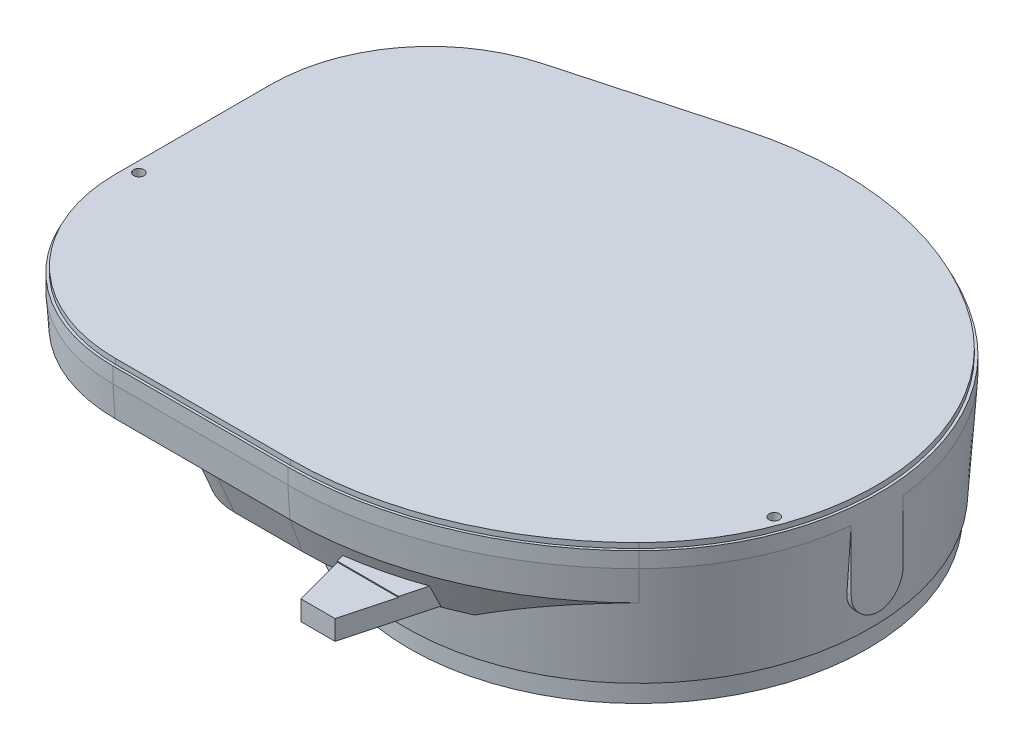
ISO-10303-21;
HEADER;
FILE_DESCRIPTION(('STEP AP214'),'2;1');
FILE_NAME('part.step','',(''),(''),'','','');
FILE_SCHEMA(('AUTOMOTIVE_DESIGN { 1 0 10303 214 1 1 1 1 }'));
ENDSEC;
DATA;
#1=APPLICATION_CONTEXT('core data for automotive mechanical design processes');
#2=APPLICATION_PROTOCOL_DEFINITION('international standard','automotive_design',2000,#1);
#3=PRODUCT_CONTEXT('',#1,'mechanical');
#4=PRODUCT('Part','Part','',(#3));
#5=PRODUCT_RELATED_PRODUCT_CATEGORY('part','',(#4));
#6=PRODUCT_DEFINITION_FORMATION('','',#4);
#7=PRODUCT_DEFINITION_CONTEXT('part definition',#1,'design');
#8=PRODUCT_DEFINITION('design','',#6,#7);
#9=PRODUCT_DEFINITION_SHAPE('','',#8);
#10=(LENGTH_UNIT() NAMED_UNIT(*) SI_UNIT(.MILLI.,.METRE.));
#11=(NAMED_UNIT(*) PLANE_ANGLE_UNIT() SI_UNIT($,.RADIAN.));
#12=(NAMED_UNIT(*) SI_UNIT($,.STERADIAN.) SOLID_ANGLE_UNIT());
#13=UNCERTAINTY_MEASURE_WITH_UNIT(LENGTH_MEASURE(1.E-05),#10,'distance_accuracy_value','');
#14=(GEOMETRIC_REPRESENTATION_CONTEXT(3) GLOBAL_UNCERTAINTY_ASSIGNED_CONTEXT((#13)) GLOBAL_UNIT_ASSIGNED_CONTEXT((#10,
#11,#12)) REPRESENTATION_CONTEXT('',''));
#15=CARTESIAN_POINT('',(0.,0.,0.));
#16=DIRECTION('',(0.,0.,1.));
#17=DIRECTION('',(1.,0.,0.));
#18=AXIS2_PLACEMENT_3D('',#15,#16,#17);
#19=CARTESIAN_POINT('',(-60.2079728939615,91.,-60.));
#20=DIRECTION('',(0.,1.,0.));
#21=DIRECTION('',(0.,0.,1.));
#22=AXIS2_PLACEMENT_3D('',#19,#20,#21);
#23=CYLINDRICAL_SURFACE('',#22,268.);
#24=DIRECTION('',(0.,1.,0.));
#25=VECTOR('',#24,1.);
#26=CARTESIAN_POINT('',(129.624223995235,91.,129.176470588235));
#27=LINE('',#26,#25);
#28=CARTESIAN_POINT('',(129.624223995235,91.,129.176470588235));
#29=VERTEX_POINT('',#28);
#30=CARTESIAN_POINT('',(129.624223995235,95.,129.176470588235));
#31=VERTEX_POINT('',#30);
#32=EDGE_CURVE('E346',#29,#31,#27,.T.);
#33=ORIENTED_EDGE('',*,*,#32,.T.);
#34=CARTESIAN_POINT('',(-60.2079728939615,95.,-60.));
#35=DIRECTION('',(0.,1.,0.));
#36=DIRECTION('',(0.,0.,1.));
#37=AXIS2_PLACEMENT_3D('',#34,#35,#36);
#38=CIRCLE('',#37,268.);
#39=CARTESIAN_POINT('',(-60.2079728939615,95.,208.));
#40=VERTEX_POINT('',#39);
#41=EDGE_CURVE('E309',#31,#40,#38,.F.);
#42=ORIENTED_EDGE('',*,*,#41,.T.);
#43=DIRECTION('',(0.,1.,0.));
#44=VECTOR('',#43,1.);
#45=CARTESIAN_POINT('',(-60.2079728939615,91.,208.));
#46=LINE('',#45,#44);
#47=CARTESIAN_POINT('',(-60.2079728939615,91.,208.));
#48=VERTEX_POINT('',#47);
#49=EDGE_CURVE('E347',#48,#40,#46,.T.);
#50=ORIENTED_EDGE('',*,*,#49,.F.);
#51=CARTESIAN_POINT('',(-60.2079728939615,91.,-60.));
#52=DIRECTION('',(0.,1.,0.));
#53=DIRECTION('',(0.,0.,1.));
#54=AXIS2_PLACEMENT_3D('',#51,#52,#53);
#55=CIRCLE('',#54,268.);
#56=EDGE_CURVE('E322',#48,#29,#55,.T.);
#57=ORIENTED_EDGE('',*,*,#56,.T.);
#58=EDGE_LOOP('',(#33,#42,#50,#57));
#59=FACE_BOUND('',#58,.T.);
#60=ADVANCED_FACE('F14',(#59),#23,.T.);
#61=CARTESIAN_POINT('',(-195.,91.,208.));
#62=DIRECTION('',(0.,0.,1.));
#63=DIRECTION('',(1.,0.,0.));
#64=AXIS2_PLACEMENT_3D('',#61,#62,#63);
#65=PLANE('',#64);
#66=ORIENTED_EDGE('',*,*,#49,.T.);
#67=DIRECTION('',(-1.,0.,0.));
#68=VECTOR('',#67,1.);
#69=CARTESIAN_POINT('',(-195.,95.,208.));
#70=LINE('',#69,#68);
#71=CARTESIAN_POINT('',(-195.,95.,208.));
#72=VERTEX_POINT('',#71);
#73=EDGE_CURVE('E306',#40,#72,#70,.T.);
#74=ORIENTED_EDGE('',*,*,#73,.T.);
#75=DIRECTION('',(0.,1.,0.));
#76=VECTOR('',#75,1.);
#77=CARTESIAN_POINT('',(-195.,91.,208.));
#78=LINE('',#77,#76);
#79=CARTESIAN_POINT('',(-195.,91.,208.));
#80=VERTEX_POINT('',#79);
#81=EDGE_CURVE('E351',#80,#72,#78,.T.);
#82=ORIENTED_EDGE('',*,*,#81,.F.);
#83=DIRECTION('',(1.,0.,0.));
#84=VECTOR('',#83,1.);
#85=CARTESIAN_POINT('',(-195.,91.,208.));
#86=LINE('',#85,#84);
#87=EDGE_CURVE('E343',#80,#48,#86,.T.);
#88=ORIENTED_EDGE('',*,*,#87,.T.);
#89=EDGE_LOOP('',(#66,#74,#82,#88));
#90=FACE_BOUND('',#89,.T.);
#91=ADVANCED_FACE('F660',(#90),#65,.T.);
#92=CARTESIAN_POINT('',(-195.,91.,85.));
#93=DIRECTION('',(0.,1.,0.));
#94=DIRECTION('',(0.,0.,1.));
#95=AXIS2_PLACEMENT_3D('',#92,#93,#94);
#96=CYLINDRICAL_SURFACE('',#95,123.);
#97=ORIENTED_EDGE('',*,*,#81,.T.);
#98=CARTESIAN_POINT('',(-195.,95.,85.));
#99=DIRECTION('',(0.,1.,0.));
#100=DIRECTION('',(0.,0.,1.));
#101=AXIS2_PLACEMENT_3D('',#98,#99,#100);
#102=CIRCLE('',#101,123.);
#103=CARTESIAN_POINT('',(-318.,95.,85.));
#104=VERTEX_POINT('',#103);
#105=EDGE_CURVE('E303',#72,#104,#102,.F.);
#106=ORIENTED_EDGE('',*,*,#105,.T.);
#107=DIRECTION('',(0.,1.,0.));
#108=VECTOR('',#107,1.);
#109=CARTESIAN_POINT('',(-318.,91.,85.));
#110=LINE('',#109,#108);
#111=CARTESIAN_POINT('',(-318.,91.,85.));
#112=VERTEX_POINT('',#111);
#113=EDGE_CURVE('E354',#112,#104,#110,.T.);
#114=ORIENTED_EDGE('',*,*,#113,.F.);
#115=CARTESIAN_POINT('',(-195.,91.,85.));
#116=DIRECTION('',(0.,1.,0.));
#117=DIRECTION('',(0.,0.,1.));
#118=AXIS2_PLACEMENT_3D('',#115,#116,#117);
#119=CIRCLE('',#118,123.);
#120=EDGE_CURVE('E340',#112,#80,#119,.T.);
#121=ORIENTED_EDGE('',*,*,#120,.T.);
#122=EDGE_LOOP('',(#97,#106,#114,#121));
#123=FACE_BOUND('',#122,.T.);
#124=ADVANCED_FACE('F666',(#123),#96,.T.);
#125=CARTESIAN_POINT('',(-318.,91.,-34.663635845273));
#126=DIRECTION('',(-1.,0.,0.));
#127=DIRECTION('',(0.,0.,1.));
#128=AXIS2_PLACEMENT_3D('',#125,#126,#127);
#129=PLANE('',#128);
#130=ORIENTED_EDGE('',*,*,#113,.T.);
#131=DIRECTION('',(0.,0.,-1.));
#132=VECTOR('',#131,1.);
#133=CARTESIAN_POINT('',(-318.,95.,-34.663635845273));
#134=LINE('',#133,#132);
#135=CARTESIAN_POINT('',(-318.,95.,-34.6636358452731));
#136=VERTEX_POINT('',#135);
#137=EDGE_CURVE('E300',#104,#136,#134,.T.);
#138=ORIENTED_EDGE('',*,*,#137,.T.);
#139=DIRECTION('',(0.,1.,0.));
#140=VECTOR('',#139,1.);
#141=CARTESIAN_POINT('',(-318.,91.,-34.6636358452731));
#142=LINE('',#141,#140);
#143=CARTESIAN_POINT('',(-318.,91.,-34.6636358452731));
#144=VERTEX_POINT('',#143);
#145=EDGE_CURVE('E357',#144,#136,#142,.T.);
#146=ORIENTED_EDGE('',*,*,#145,.F.);
#147=DIRECTION('',(0.,0.,1.));
#148=VECTOR('',#147,1.);
#149=CARTESIAN_POINT('',(-318.,91.,-34.663635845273));
#150=LINE('',#149,#148);
#151=EDGE_CURVE('E337',#144,#112,#150,.T.);
#152=ORIENTED_EDGE('',*,*,#151,.T.);
#153=EDGE_LOOP('',(#130,#138,#146,#152));
#154=FACE_BOUND('',#153,.T.);
#155=ADVANCED_FACE('F886',(#154),#129,.T.);
#156=CARTESIAN_POINT('',(-195.,91.,-34.6636358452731));
#157=DIRECTION('',(0.,1.,0.));
#158=DIRECTION('',(0.,0.,1.));
#159=AXIS2_PLACEMENT_3D('',#156,#157,#158);
#160=CYLINDRICAL_SURFACE('',#159,123.);
#161=ORIENTED_EDGE('',*,*,#145,.T.);
#162=CARTESIAN_POINT('',(-195.,95.,-34.6636358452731));
#163=DIRECTION('',(0.,1.,0.));
#164=DIRECTION('',(0.,0.,1.));
#165=AXIS2_PLACEMENT_3D('',#162,#163,#164);
#166=CIRCLE('',#165,123.);
#167=CARTESIAN_POINT('',(-227.529114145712,95.,-153.284277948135));
#168=VERTEX_POINT('',#167);
#169=EDGE_CURVE('E297',#136,#168,#166,.F.);
#170=ORIENTED_EDGE('',*,*,#169,.T.);
#171=DIRECTION('',(0.,1.,0.));
#172=VECTOR('',#171,1.);
#173=CARTESIAN_POINT('',(-227.529114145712,91.,-153.284277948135));
#174=LINE('',#173,#172);
#175=CARTESIAN_POINT('',(-227.529114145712,91.,-153.284277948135));
#176=VERTEX_POINT('',#175);
#177=EDGE_CURVE('E360',#176,#168,#174,.T.);
#178=ORIENTED_EDGE('',*,*,#177,.F.);
#179=CARTESIAN_POINT('',(-195.,91.,-34.6636358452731));
#180=DIRECTION('',(0.,1.,0.));
#181=DIRECTION('',(0.,0.,1.));
#182=AXIS2_PLACEMENT_3D('',#179,#180,#181);
#183=CIRCLE('',#182,123.);
#184=EDGE_CURVE('E334',#176,#144,#183,.T.);
#185=ORIENTED_EDGE('',*,*,#184,.T.);
#186=EDGE_LOOP('',(#161,#170,#178,#185));
#187=FACE_BOUND('',#186,.T.);
#188=ADVANCED_FACE('F890',(#187),#160,.T.);
#189=CARTESIAN_POINT('',(-104.419147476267,91.,-187.044491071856));
#190=DIRECTION('',(-0.264464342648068,0.,-0.964395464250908));
#191=DIRECTION('',(-0.964395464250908,0.,0.264464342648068));
#192=AXIS2_PLACEMENT_3D('',#189,#190,#191);
#193=PLANE('',#192);
#194=ORIENTED_EDGE('',*,*,#177,.T.);
#195=DIRECTION('',(0.964395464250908,0.,-0.264464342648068));
#196=VECTOR('',#195,1.);
#197=CARTESIAN_POINT('',(-104.419147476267,95.,-187.044491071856));
#198=LINE('',#197,#196);
#199=CARTESIAN_POINT('',(-104.419147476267,95.,-187.044491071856));
#200=VERTEX_POINT('',#199);
#201=EDGE_CURVE('E294',#168,#200,#198,.T.);
#202=ORIENTED_EDGE('',*,*,#201,.T.);
#203=DIRECTION('',(0.,1.,0.));
#204=VECTOR('',#203,1.);
#205=CARTESIAN_POINT('',(-104.419147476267,91.,-187.044491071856));
#206=LINE('',#205,#204);
#207=CARTESIAN_POINT('',(-104.419147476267,91.,-187.044491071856));
#208=VERTEX_POINT('',#207);
#209=EDGE_CURVE('E363',#208,#200,#206,.T.);
#210=ORIENTED_EDGE('',*,*,#209,.F.);
#211=DIRECTION('',(-0.964395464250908,0.,0.264464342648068));
#212=VECTOR('',#211,1.);
#213=CARTESIAN_POINT('',(-104.419147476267,91.,-187.044491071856));
#214=LINE('',#213,#212);
#215=EDGE_CURVE('E331',#208,#176,#214,.T.);
#216=ORIENTED_EDGE('',*,*,#215,.T.);
#217=EDGE_LOOP('',(#194,#202,#210,#216));
#218=FACE_BOUND('',#217,.T.);
#219=ADVANCED_FACE('F894',(#218),#193,.T.);
#220=CARTESIAN_POINT('',(-38.8319904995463,91.,52.1255840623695));
#221=DIRECTION('',(0.,1.,0.));
#222=DIRECTION('',(0.,0.,1.));
#223=AXIS2_PLACEMENT_3D('',#220,#221,#222);
#224=CYLINDRICAL_SURFACE('',#223,248.);
#225=ORIENTED_EDGE('',*,*,#209,.T.);
#226=CARTESIAN_POINT('',(-38.8319904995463,95.,52.1255840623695));
#227=DIRECTION('',(0.,1.,0.));
#228=DIRECTION('',(0.,0.,1.));
#229=AXIS2_PLACEMENT_3D('',#226,#227,#228);
#230=CIRCLE('',#229,248.);
#231=CARTESIAN_POINT('',(109.326988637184,95.,-146.753567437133));
#232=VERTEX_POINT('',#231);
#233=EDGE_CURVE('E291',#200,#232,#230,.F.);
#234=ORIENTED_EDGE('',*,*,#233,.T.);
#235=DIRECTION('',(0.,1.,0.));
#236=VECTOR('',#235,1.);
#237=CARTESIAN_POINT('',(109.326988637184,91.,-146.753567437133));
#238=LINE('',#237,#236);
#239=CARTESIAN_POINT('',(109.326988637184,91.,-146.753567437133));
#240=VERTEX_POINT('',#239);
#241=EDGE_CURVE('E366',#240,#232,#238,.T.);
#242=ORIENTED_EDGE('',*,*,#241,.F.);
#243=CARTESIAN_POINT('',(-38.8319904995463,91.,52.1255840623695));
#244=DIRECTION('',(0.,1.,0.));
#245=DIRECTION('',(0.,0.,1.));
#246=AXIS2_PLACEMENT_3D('',#243,#244,#245);
#247=CIRCLE('',#246,248.);
#248=EDGE_CURVE('E328',#240,#208,#247,.T.);
#249=ORIENTED_EDGE('',*,*,#248,.T.);
#250=EDGE_LOOP('',(#225,#234,#242,#249));
#251=FACE_BOUND('',#250,.T.);
#252=ADVANCED_FACE('F897',(#251),#224,.T.);
#253=CARTESIAN_POINT('',(0.,91.,0.));
#254=DIRECTION('',(0.,1.,0.));
#255=DIRECTION('',(0.,0.,1.));
#256=AXIS2_PLACEMENT_3D('',#253,#254,#255);
#257=CYLINDRICAL_SURFACE('',#256,183.);
#258=ORIENTED_EDGE('',*,*,#241,.T.);
#259=CARTESIAN_POINT('',(0.,95.,0.));
#260=DIRECTION('',(0.,1.,0.));
#261=DIRECTION('',(0.,0.,1.));
#262=AXIS2_PLACEMENT_3D('',#259,#260,#261);
#263=CIRCLE('',#262,183.);
#264=EDGE_CURVE('E912',#232,#31,#263,.F.);
#265=ORIENTED_EDGE('',*,*,#264,.T.);
#266=ORIENTED_EDGE('',*,*,#32,.F.);
#267=CARTESIAN_POINT('',(0.,91.,0.));
#268=DIRECTION('',(0.,1.,0.));
#269=DIRECTION('',(0.,0.,1.));
#270=AXIS2_PLACEMENT_3D('',#267,#268,#269);
#271=CIRCLE('',#270,183.);
#272=EDGE_CURVE('E325',#29,#240,#271,.T.);
#273=ORIENTED_EDGE('',*,*,#272,.T.);
#274=EDGE_LOOP('',(#258,#265,#266,#273));
#275=FACE_BOUND('',#274,.T.);
#276=ADVANCED_FACE('F444',(#275),#257,.T.);
#277=CARTESIAN_POINT('',(0.,-17.,0.));
#278=DIRECTION('',(0.,1.,0.));
#279=DIRECTION('',(0.,0.,1.));
#280=AXIS2_PLACEMENT_3D('',#277,#278,#279);
#281=CONICAL_SURFACE('',#280,178.287026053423,0.0698131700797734);
#282=CARTESIAN_POINT('',(180.609452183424,32.,-20.));
#283=CARTESIAN_POINT('',(180.589790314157,31.7205442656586,-20.0000003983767));
#284=CARTESIAN_POINT('',(180.570778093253,31.4410736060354,-19.9941421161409));
#285=CARTESIAN_POINT('',(180.53407653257,30.8825423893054,-19.9707141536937));
#286=CARTESIAN_POINT('',(180.516387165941,30.6034818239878,-19.9531447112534));
#287=CARTESIAN_POINT('',(180.465345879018,29.7676942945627,-19.8828896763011));
#288=CARTESIAN_POINT('',(180.434011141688,29.2122245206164,-19.8126573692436));
#289=CARTESIAN_POINT('',(180.376842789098,28.1092810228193,-19.6258734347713));
#290=CARTESIAN_POINT('',(180.351004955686,27.5618014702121,-19.5093575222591));
#291=CARTESIAN_POINT('',(180.316300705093,26.7493451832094,-19.3004890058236));
#292=CARTESIAN_POINT('',(180.305407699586,26.4799768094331,-19.2251801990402));
#293=CARTESIAN_POINT('',(180.284943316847,25.9445195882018,-19.0633000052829));
#294=CARTESIAN_POINT('',(180.275372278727,25.6784315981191,-18.9767257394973));
#295=CARTESIAN_POINT('',(180.248598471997,24.885711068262,-18.700269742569));
#296=CARTESIAN_POINT('',(180.233339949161,24.3647385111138,-18.4936847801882));
#297=CARTESIAN_POINT('',(180.207684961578,23.3418696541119,-18.0374715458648));
#298=CARTESIAN_POINT('',(180.197288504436,22.839973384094,-17.7878432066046));
#299=CARTESIAN_POINT('',(180.185001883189,22.104252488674,-17.382538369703));
#300=CARTESIAN_POINT('',(180.181457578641,21.8618527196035,-17.2422841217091));
#301=CARTESIAN_POINT('',(180.175405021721,21.3832070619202,-16.9517571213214));
#302=CARTESIAN_POINT('',(180.17289650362,21.1469596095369,-16.8014869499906));
#303=CARTESIAN_POINT('',(180.166820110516,20.4479512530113,-16.3359570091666));
#304=CARTESIAN_POINT('',(180.164700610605,19.9948754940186,-16.0059508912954));
#305=CARTESIAN_POINT('',(180.163715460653,19.1181297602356,-15.309181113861));
#306=CARTESIAN_POINT('',(180.164849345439,18.6944555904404,-14.9424227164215));
#307=CARTESIAN_POINT('',(180.169705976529,17.8793561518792,-14.1746547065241));
#308=CARTESIAN_POINT('',(180.173428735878,17.4879310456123,-13.7736449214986));
#309=CARTESIAN_POINT('',(180.182777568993,16.7399637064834,-12.9400547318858));
#310=CARTESIAN_POINT('',(180.188404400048,16.3834354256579,-12.507461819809));
#311=CARTESIAN_POINT('',(180.200871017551,15.707947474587,-11.6139012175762));
#312=CARTESIAN_POINT('',(180.207710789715,15.3889873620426,-11.1529338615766));
#313=CARTESIAN_POINT('',(180.2219610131,14.7898086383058,-10.2041765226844));
#314=CARTESIAN_POINT('',(180.229373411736,14.5097321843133,-9.71629678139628));
#315=CARTESIAN_POINT('',(180.244117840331,13.9916420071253,-8.71865821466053));
#316=CARTESIAN_POINT('',(180.251449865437,13.7536308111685,-8.20889807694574));
#317=CARTESIAN_POINT('',(180.265461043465,13.3216026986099,-7.17166173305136));
#318=CARTESIAN_POINT('',(180.272140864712,13.1275404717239,-6.64420442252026));
#319=CARTESIAN_POINT('',(180.284376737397,12.7845190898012,-5.57499330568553));
#320=CARTESIAN_POINT('',(180.289933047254,12.6355495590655,-5.03324281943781));
#321=CARTESIAN_POINT('',(180.301187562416,12.3405084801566,-3.75133729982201));
#322=CARTESIAN_POINT('',(180.306281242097,12.2129427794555,-3.00684238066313));
#323=CARTESIAN_POINT('',(180.31313833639,12.0426916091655,-1.50817723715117));
#324=CARTESIAN_POINT('',(180.314901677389,12.0000080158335,-0.754006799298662));
#325=CARTESIAN_POINT('',(180.314905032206,11.9999940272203,0.561827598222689));
#326=CARTESIAN_POINT('',(180.313928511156,12.0236818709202,1.12356434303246));
#327=CARTESIAN_POINT('',(180.310088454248,12.1182606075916,2.24322204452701));
#328=CARTESIAN_POINT('',(180.307224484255,12.1891623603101,2.80114209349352));
#329=CARTESIAN_POINT('',(180.299791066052,12.3777708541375,3.90953926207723));
#330=CARTESIAN_POINT('',(180.295219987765,12.4955223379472,4.46000874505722));
#331=CARTESIAN_POINT('',(180.284679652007,12.7769783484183,5.5490270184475));
#332=CARTESIAN_POINT('',(180.278710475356,12.9406802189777,6.08757649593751));
#333=CARTESIAN_POINT('',(180.265791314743,13.3127919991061,7.14872360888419));
#334=CARTESIAN_POINT('',(180.258841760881,13.5211823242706,7.67132811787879));
#335=CARTESIAN_POINT('',(180.244469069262,13.9812355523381,8.69713238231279));
#336=CARTESIAN_POINT('',(180.237045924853,14.2328990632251,9.20033186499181));
#337=CARTESIAN_POINT('',(180.222315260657,14.7776594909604,10.1836560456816));
#338=CARTESIAN_POINT('',(180.215007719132,15.0707485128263,10.6637851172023));
#339=CARTESIAN_POINT('',(180.201153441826,15.6963185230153,11.59766511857));
#340=CARTESIAN_POINT('',(180.194606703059,16.0287993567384,12.0514161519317));
#341=CARTESIAN_POINT('',(180.182955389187,16.7309820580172,12.9295514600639));
#342=CARTESIAN_POINT('',(180.177851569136,17.1007032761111,13.3539202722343));
#343=CARTESIAN_POINT('',(180.169791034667,17.8745984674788,14.1700127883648));
#344=CARTESIAN_POINT('',(180.166834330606,18.2787726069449,14.5617363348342));
#345=CARTESIAN_POINT('',(180.163759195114,19.118716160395,15.3097617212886));
#346=CARTESIAN_POINT('',(180.163640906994,19.5544871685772,15.6660617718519));
#347=CARTESIAN_POINT('',(180.166900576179,20.4544866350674,16.3406666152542));
#348=CARTESIAN_POINT('',(180.170278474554,20.9187146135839,16.6589720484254));
#349=CARTESIAN_POINT('',(180.181121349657,21.8715445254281,17.2548436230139));
#350=CARTESIAN_POINT('',(180.188579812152,22.3601064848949,17.5324738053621));
#351=CARTESIAN_POINT('',(180.20809661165,23.3588130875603,18.0456388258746));
#352=CARTESIAN_POINT('',(180.220155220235,23.8689590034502,18.2811711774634));
#353=CARTESIAN_POINT('',(180.249280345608,24.9069061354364,18.7083640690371));
#354=CARTESIAN_POINT('',(180.266344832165,25.4347001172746,18.9000423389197));
#355=CARTESIAN_POINT('',(180.305778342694,26.5042746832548,19.2382805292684));
#356=CARTESIAN_POINT('',(180.328146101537,27.0460519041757,19.3848511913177));
#357=CARTESIAN_POINT('',(180.369843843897,27.954565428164,19.5901021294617));
#358=CARTESIAN_POINT('',(180.387640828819,28.31850136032,19.6617404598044));
#359=CARTESIAN_POINT('',(180.425634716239,29.0496648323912,19.7846634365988));
#360=CARTESIAN_POINT('',(180.445831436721,29.4168921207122,19.8359496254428));
#361=CARTESIAN_POINT('',(180.488578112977,30.1529159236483,19.9179608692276));
#362=CARTESIAN_POINT('',(180.511124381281,30.5217091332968,19.9487175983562));
#363=CARTESIAN_POINT('',(180.55855083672,31.2603606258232,19.9897448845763));
#364=CARTESIAN_POINT('',(180.583431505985,31.6302191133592,20.0000111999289));
#365=CARTESIAN_POINT('',(180.609452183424,32.,20.));
#366=B_SPLINE_CURVE_WITH_KNOTS('',3,(#282,#283,#284,#285,#286,#287,#288,#289,#290,#291,#292,
#293,#294,#295,#296,#297,#298,#299,#300,#301,#302,#303,#304,#305,#306,#307,#308,#309,#310,#311,
#312,#313,#314,#315,#316,#317,#318,#319,#320,#321,#322,#323,#324,#325,#326,#327,#328,#329,#330,
#331,#332,#333,#334,#335,#336,#337,#338,#339,#340,#341,#342,#343,#344,#345,#346,#347,#348,#349,
#350,#351,#352,#353,#354,#355,#356,#357,#358,#359,#360,#361,#362,#363,#364,#365),.UNSPECIFIED.,
.F.,.F.,(4,2,2,2,2,2,2,2,2,2,2,2,2,2,2,2,2,2,2,2,2,2,2,2,2,2,2,2,2,2,2,2,2,2,2,2,2,2,2,2,2,4),
(0.,0.840316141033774,1.68061522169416,3.36080277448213,5.03969631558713,5.8792072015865,
6.71893304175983,8.39874485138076,10.0785592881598,10.9185627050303,11.758350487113,
13.4377592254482,15.1169278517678,16.7961049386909,18.4759506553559,20.1557765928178,
21.8415907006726,23.5275060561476,25.2116752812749,26.8954566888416,29.1565463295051,
31.4176859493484,33.102512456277,34.7877266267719,36.4745540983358,38.1612840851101,
39.8472763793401,41.5332923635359,43.2189874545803,44.9046759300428,46.5912448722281,
48.2778219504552,49.9644841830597,51.6511179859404,53.3350670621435,55.0191155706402,
56.7024820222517,58.3854472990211,59.4989600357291,60.6123883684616,61.7240948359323,
62.8360314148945),.UNSPECIFIED.);
#367=CARTESIAN_POINT('',(180.609452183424,32.,-20.));
#368=VERTEX_POINT('',#367);
#369=CARTESIAN_POINT('',(180.609452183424,31.9999999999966,20.));
#370=VERTEX_POINT('',#369);
#371=EDGE_CURVE('E914',#368,#370,#366,.T.);
#372=ORIENTED_EDGE('',*,*,#371,.T.);
#373=CARTESIAN_POINT('',(188.320173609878,141.625719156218,20.));
#374=CARTESIAN_POINT('',(186.900561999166,121.437862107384,20.));
#375=CARTESIAN_POINT('',(185.480773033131,101.250017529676,20.));
#376=CARTESIAN_POINT('',(182.640813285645,60.8743552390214,20.));
#377=CARTESIAN_POINT('',(181.220642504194,40.6865375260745,20.));
#378=CARTESIAN_POINT('',(178.379892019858,0.31093086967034,20.));
#379=CARTESIAN_POINT('',(176.959312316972,-19.8768580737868,20.));
#380=CARTESIAN_POINT('',(174.117712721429,-60.2524049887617,20.));
#381=CARTESIAN_POINT('',(172.69669282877,-80.4401629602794,20.));
#382=CARTESIAN_POINT('',(171.275437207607,-100.627904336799,20.));
#383=B_SPLINE_CURVE_WITH_KNOTS('',3,(#373,#374,#375,#376,#377,#378,#379,#380,#381,#382),
.UNSPECIFIED.,.F.,.F.,(4,2,2,2,4),(0.,60.7131272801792,121.42625453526,182.139381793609,
242.852509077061),.UNSPECIFIED.);
#384=CARTESIAN_POINT('',(183.915741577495,79.,20.));
#385=VERTEX_POINT('',#384);
#386=EDGE_CURVE('E388',#385,#370,#383,.T.);
#387=ORIENTED_EDGE('',*,*,#386,.F.);
#388=CARTESIAN_POINT('',(0.,79.,0.));
#389=DIRECTION('',(0.,1.,0.));
#390=DIRECTION('',(0.,0.,1.));
#391=AXIS2_PLACEMENT_3D('',#388,#389,#390);
#392=CIRCLE('',#391,185.);
#393=CARTESIAN_POINT('',(131.040882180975,79.,130.588235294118));
#394=VERTEX_POINT('',#393);
#395=EDGE_CURVE('E795',#394,#385,#392,.T.);
#396=ORIENTED_EDGE('',*,*,#395,.F.);
#397=DIRECTION('',(-0.0494105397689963,-0.997564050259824,-0.0492398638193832));
#398=VECTOR('',#397,1.);
#399=CARTESIAN_POINT('',(131.040882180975,79.,130.588235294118));
#400=LINE('',#399,#398);
#401=CARTESIAN_POINT('',(129.852133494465,55.,129.403592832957));
#402=VERTEX_POINT('',#401);
#403=EDGE_CURVE('E800',#394,#402,#400,.T.);
#404=ORIENTED_EDGE('',*,*,#403,.T.);
#405=CARTESIAN_POINT('',(129.852333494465,54.9999999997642,129.40339213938));
#406=CARTESIAN_POINT('',(129.180888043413,55.000002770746,130.077169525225));
#407=CARTESIAN_POINT('',(128.503826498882,54.9920265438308,130.745298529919));
#408=CARTESIAN_POINT('',(127.138817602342,54.9601338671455,132.069942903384));
#409=CARTESIAN_POINT('',(126.450870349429,54.9362175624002,132.72645837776));
#410=CARTESIAN_POINT('',(124.371352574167,54.8405919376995,134.677985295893));
#411=CARTESIAN_POINT('',(122.963959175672,54.7450058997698,135.955124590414));
#412=CARTESIAN_POINT('',(120.111486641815,54.4906879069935,138.458077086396));
#413=CARTESIAN_POINT('',(118.666431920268,54.3319959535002,139.683922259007));
#414=CARTESIAN_POINT('',(115.741199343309,53.9521944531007,142.082935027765));
#415=CARTESIAN_POINT('',(114.261021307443,53.7310845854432,143.256102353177));
#416=CARTESIAN_POINT('',(111.278144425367,53.2289558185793,145.540915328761));
#417=CARTESIAN_POINT('',(109.775633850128,52.9483041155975,146.652887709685));
#418=CARTESIAN_POINT('',(106.743058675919,52.3275279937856,148.821294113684));
#419=CARTESIAN_POINT('',(105.212993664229,51.9874026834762,149.877727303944));
#420=CARTESIAN_POINT('',(102.1288486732,51.2490891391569,151.933871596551));
#421=CARTESIAN_POINT('',(100.574767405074,50.8508977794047,152.933579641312));
#422=CARTESIAN_POINT('',(97.446230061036,49.9980720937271,154.875334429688));
#423=CARTESIAN_POINT('',(95.8717739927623,49.5434377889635,155.817381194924));
#424=CARTESIAN_POINT('',(92.7101030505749,48.5807390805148,157.640879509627));
#425=CARTESIAN_POINT('',(91.1229322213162,48.0728172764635,158.522482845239));
#426=CARTESIAN_POINT('',(87.934977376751,47.0043741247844,160.227625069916));
#427=CARTESIAN_POINT('',(86.3341920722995,46.4438477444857,161.051158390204));
#428=CARTESIAN_POINT('',(83.1223753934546,45.2721800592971,162.640107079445));
#429=CARTESIAN_POINT('',(81.5113440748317,44.6610390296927,163.405522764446));
#430=CARTESIAN_POINT('',(78.2819308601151,43.3900783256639,164.878607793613));
#431=CARTESIAN_POINT('',(76.6635483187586,42.7302542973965,165.586271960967));
#432=CARTESIAN_POINT('',(73.4226547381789,41.3640875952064,166.944221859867));
#433=CARTESIAN_POINT('',(71.8001442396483,40.6577507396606,167.594514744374));
#434=CARTESIAN_POINT('',(68.5533139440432,39.2004399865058,168.838614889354));
#435=CARTESIAN_POINT('',(66.9289939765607,38.4494614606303,169.432416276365));
#436=CARTESIAN_POINT('',(63.6819755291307,36.905314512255,170.564092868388));
#437=CARTESIAN_POINT('',(62.0592766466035,36.1121657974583,171.10199385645));
#438=CARTESIAN_POINT('',(58.8170323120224,34.4853325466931,172.123232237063));
#439=CARTESIAN_POINT('',(57.1974868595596,33.6516480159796,172.606569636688));
#440=CARTESIAN_POINT('',(54.4164144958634,32.1845250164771,173.391981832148));
#441=CARTESIAN_POINT('',(53.2535943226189,31.5603663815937,173.706920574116));
#442=CARTESIAN_POINT('',(50.9333644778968,30.293809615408,174.309073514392));
#443=CARTESIAN_POINT('',(49.7759490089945,29.6514437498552,174.596333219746));
#444=CARTESIAN_POINT('',(48.6206013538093,28.9998,174.870267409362));
#445=B_SPLINE_CURVE_WITH_KNOTS('',3,(#405,#406,#407,#408,#409,#410,#411,#412,#413,#414,#415,
#416,#417,#418,#419,#420,#421,#422,#423,#424,#425,#426,#427,#428,#429,#430,#431,#432,#433,#434,
#435,#436,#437,#438,#439,#440,#441,#442,#443,#444),.UNSPECIFIED.,.F.,.F.,(4,2,2,2,2,2,2,2,2,2,2,
2,2,2,2,2,2,2,2,4),(0.,2.85351301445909,5.70700006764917,11.4133506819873,17.1160899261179,
22.8188584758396,28.4874302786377,34.1560870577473,39.8250490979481,45.4940090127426,
51.1481678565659,56.8028681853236,62.4575377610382,68.1127136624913,73.7671834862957,
79.4222405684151,85.0746776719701,90.7271140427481,94.7971255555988,98.8603271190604),.UNSPECIFIED.);
#446=CARTESIAN_POINT('',(48.6209559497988,29.,174.87018333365));
#447=VERTEX_POINT('',#446);
#448=EDGE_CURVE('E451',#402,#447,#445,.T.);
#449=ORIENTED_EDGE('',*,*,#448,.T.);
#450=CARTESIAN_POINT('',(0.,29.,0.));
#451=DIRECTION('',(0.,1.,0.));
#452=DIRECTION('',(0.,0.,1.));
#453=AXIS2_PLACEMENT_3D('',#450,#451,#452);
#454=CIRCLE('',#453,181.503659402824);
#455=CARTESIAN_POINT('',(13.0258799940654,29.,-181.035645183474));
#456=VERTEX_POINT('',#455);
#457=EDGE_CURVE('E465',#447,#456,#454,.F.);
#458=ORIENTED_EDGE('',*,*,#457,.T.);
#459=CARTESIAN_POINT('',(13.0254775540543,28.9998,-181.03566011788));
#460=CARTESIAN_POINT('',(14.8910837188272,29.9269608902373,-180.966444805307));
#461=CARTESIAN_POINT('',(16.7652666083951,30.8347319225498,-180.866382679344));
#462=CARTESIAN_POINT('',(20.5285307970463,32.6097061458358,-180.602888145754));
#463=CARTESIAN_POINT('',(22.4176134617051,33.4769055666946,-180.439449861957));
#464=CARTESIAN_POINT('',(26.2095994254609,35.1694561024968,-180.047380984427));
#465=CARTESIAN_POINT('',(28.1125126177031,35.9947730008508,-179.818698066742));
#466=CARTESIAN_POINT('',(31.9278958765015,37.6008748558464,-179.294668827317));
#467=CARTESIAN_POINT('',(33.8403657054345,38.3816609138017,-178.999324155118));
#468=CARTESIAN_POINT('',(37.68507995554,39.9019713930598,-178.338321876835));
#469=CARTESIAN_POINT('',(39.6173702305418,40.6411776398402,-177.972197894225));
#470=CARTESIAN_POINT('',(43.485496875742,42.0705403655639,-177.169710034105));
#471=CARTESIAN_POINT('',(45.4213331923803,42.760697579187,-176.733347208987));
#472=CARTESIAN_POINT('',(49.292648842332,44.0898537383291,-175.789455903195));
#473=CARTESIAN_POINT('',(51.2281281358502,44.728866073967,-175.281946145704));
#474=CARTESIAN_POINT('',(55.0955995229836,45.9540275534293,-174.194867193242));
#475=CARTESIAN_POINT('',(57.0275916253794,46.5401768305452,-173.615298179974));
#476=CARTESIAN_POINT('',(60.8940143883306,47.6605982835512,-172.380443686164));
#477=CARTESIAN_POINT('',(62.8284080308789,48.1945933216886,-171.724790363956));
#478=CARTESIAN_POINT('',(66.6857587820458,49.2055514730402,-170.339892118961));
#479=CARTESIAN_POINT('',(68.608715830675,49.6825142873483,-169.610646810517));
#480=CARTESIAN_POINT('',(72.4395001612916,50.5778678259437,-168.078437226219));
#481=CARTESIAN_POINT('',(74.3473231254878,50.9962423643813,-167.275452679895));
#482=CARTESIAN_POINT('',(78.142944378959,51.7727404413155,-165.596382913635));
#483=CARTESIAN_POINT('',(80.0307429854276,52.130864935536,-164.720298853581));
#484=CARTESIAN_POINT('',(83.7731607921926,52.7839938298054,-162.900099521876));
#485=CARTESIAN_POINT('',(85.6278939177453,53.079285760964,-161.956321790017));
#486=CARTESIAN_POINT('',(89.3089273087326,53.607739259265,-159.998256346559));
#487=CARTESIAN_POINT('',(91.1352260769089,53.8408975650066,-158.983964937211));
#488=CARTESIAN_POINT('',(94.7536054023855,54.2440013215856,-156.887253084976));
#489=CARTESIAN_POINT('',(96.5457096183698,54.4139921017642,-155.804882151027));
#490=CARTESIAN_POINT('',(100.09255931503,54.690292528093,-153.573416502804));
#491=CARTESIAN_POINT('',(101.84731230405,54.7966150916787,-152.424335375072));
#492=CARTESIAN_POINT('',(104.083404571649,54.8924160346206,-150.901035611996));
#493=CARTESIAN_POINT('',(104.583810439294,54.9112429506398,-150.556258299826));
#494=CARTESIAN_POINT('',(105.581004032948,54.9435188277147,-149.861399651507));
#495=CARTESIAN_POINT('',(106.077792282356,54.9569685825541,-149.511319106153));
#496=CARTESIAN_POINT('',(107.067538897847,54.9784843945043,-148.806001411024));
#497=CARTESIAN_POINT('',(107.560498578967,54.9865523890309,-148.450766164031));
#498=CARTESIAN_POINT('',(108.542748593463,54.997311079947,-147.735028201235));
#499=CARTESIAN_POINT('',(109.032038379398,55.0000009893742,-147.374524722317));
#500=CARTESIAN_POINT('',(109.519410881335,54.9999999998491,-147.011445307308));
#501=B_SPLINE_CURVE_WITH_KNOTS('',3,(#459,#460,#461,#462,#463,#464,#465,#466,#467,#468,#469,
#470,#471,#472,#473,#474,#475,#476,#477,#478,#479,#480,#481,#482,#483,#484,#485,#486,#487,#488,
#489,#490,#491,#492,#493,#494,#495,#496,#497,#498,#499,#500),.UNSPECIFIED.,.F.,.F.,(4,2,2,2,2,2,
2,2,2,2,2,2,2,2,2,2,2,2,2,2,4),(0.,6.25310709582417,12.5067941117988,18.7655105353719,
25.0240721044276,31.3253717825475,37.6265770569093,43.9261271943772,50.2256614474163,
56.5570312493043,62.8884342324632,69.2215829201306,75.5546311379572,81.8580435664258,
88.1617867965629,94.4609976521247,100.758930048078,102.582818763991,104.406438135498,
106.229400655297,108.05262990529),.UNSPECIFIED.);
#502=CARTESIAN_POINT('',(109.519210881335,55.,-147.01159430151));
#503=VERTEX_POINT('',#502);
#504=EDGE_CURVE('E459',#456,#503,#501,.T.);
#505=ORIENTED_EDGE('',*,*,#504,.T.);
#506=DIRECTION('',(-0.0416735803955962,-0.997564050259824,0.0559399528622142));
#507=VECTOR('',#506,1.);
#508=CARTESIAN_POINT('',(110.521819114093,79.,-148.357431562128));
#509=LINE('',#508,#507);
#510=CARTESIAN_POINT('',(110.521819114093,79.,-148.357431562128));
#511=VERTEX_POINT('',#510);
#512=EDGE_CURVE('E791',#511,#503,#509,.T.);
#513=ORIENTED_EDGE('',*,*,#512,.F.);
#514=CARTESIAN_POINT('',(183.915741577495,79.,-20.));
#515=VERTEX_POINT('',#514);
#516=EDGE_CURVE('E623',#515,#511,#392,.T.);
#517=ORIENTED_EDGE('',*,*,#516,.F.);
#518=CARTESIAN_POINT('',(171.275437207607,-100.627904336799,-20.));
#519=CARTESIAN_POINT('',(172.69669282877,-80.4401629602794,-20.));
#520=CARTESIAN_POINT('',(174.117712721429,-60.2524049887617,-20.));
#521=CARTESIAN_POINT('',(176.959312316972,-19.8768580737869,-20.));
#522=CARTESIAN_POINT('',(178.379892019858,0.310930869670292,-20.));
#523=CARTESIAN_POINT('',(181.220642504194,40.6865375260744,-20.));
#524=CARTESIAN_POINT('',(182.640813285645,60.8743552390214,-20.));
#525=CARTESIAN_POINT('',(185.480773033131,101.250017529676,-20.));
#526=CARTESIAN_POINT('',(186.900561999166,121.437862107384,-20.));
#527=CARTESIAN_POINT('',(188.320173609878,141.625719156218,-20.));
#528=B_SPLINE_CURVE_WITH_KNOTS('',3,(#518,#519,#520,#521,#522,#523,#524,#525,#526,#527),
.UNSPECIFIED.,.F.,.F.,(4,2,2,2,4),(0.,60.7131272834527,121.426254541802,182.139381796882,
242.852509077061),.UNSPECIFIED.);
#529=EDGE_CURVE('E396',#368,#515,#528,.T.);
#530=ORIENTED_EDGE('',*,*,#529,.F.);
#531=EDGE_LOOP('',(#372,#387,#396,#404,#449,#458,#505,#513,#517,#530));
#532=FACE_BOUND('',#531,.T.);
#533=CARTESIAN_POINT('',(0.,-1.5,0.));
#534=DIRECTION('',(0.,-1.,0.));
#535=DIRECTION('',(0.,0.,-1.));
#536=AXIS2_PLACEMENT_3D('',#533,#534,#535);
#537=CIRCLE('',#536,179.370891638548);
#538=CARTESIAN_POINT('',(0.,-1.5,-179.370891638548));
#539=VERTEX_POINT('',#538);
#540=EDGE_CURVE('E315',#539,#539,#537,.F.);
#541=ORIENTED_EDGE('',*,*,#540,.T.);
#542=EDGE_LOOP('',(#541));
#543=FACE_BOUND('',#542,.T.);
#544=ADVANCED_FACE('F437',(#532,#543),#281,.T.);
#545=CARTESIAN_POINT('',(0.,0.,0.));
#546=DIRECTION('',(0.,-1.,0.));
#547=DIRECTION('',(0.,0.,-1.));
#548=AXIS2_PLACEMENT_3D('',#545,#546,#547);
#549=CYLINDRICAL_SURFACE('',#548,185.);
#550=DIRECTION('',(0.,1.,0.));
#551=VECTOR('',#550,1.);
#552=CARTESIAN_POINT('',(110.521819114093,55.,-148.357431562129));
#553=LINE('',#552,#551);
#554=CARTESIAN_POINT('',(110.521819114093,91.,-148.357431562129));
#555=VERTEX_POINT('',#554);
#556=EDGE_CURVE('E697',#511,#555,#553,.T.);
#557=ORIENTED_EDGE('',*,*,#556,.T.);
#558=CARTESIAN_POINT('',(0.,91.,0.));
#559=DIRECTION('',(0.,1.,0.));
#560=DIRECTION('',(0.,0.,1.));
#561=AXIS2_PLACEMENT_3D('',#558,#559,#560);
#562=CIRCLE('',#561,185.);
#563=CARTESIAN_POINT('',(131.040882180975,91.,130.588235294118));
#564=VERTEX_POINT('',#563);
#565=EDGE_CURVE('E372',#564,#555,#562,.T.);
#566=ORIENTED_EDGE('',*,*,#565,.F.);
#567=DIRECTION('',(0.,1.,0.));
#568=VECTOR('',#567,1.);
#569=CARTESIAN_POINT('',(131.040882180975,55.,130.588235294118));
#570=LINE('',#569,#568);
#571=EDGE_CURVE('E695',#394,#564,#570,.T.);
#572=ORIENTED_EDGE('',*,*,#571,.F.);
#573=ORIENTED_EDGE('',*,*,#395,.T.);
#574=DIRECTION('',(0.,-1.,0.));
#575=VECTOR('',#574,1.);
#576=CARTESIAN_POINT('',(183.915741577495,99.001,20.));
#577=LINE('',#576,#575);
#578=CARTESIAN_POINT('',(183.915741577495,32.,20.));
#579=VERTEX_POINT('',#578);
#580=EDGE_CURVE('E926',#385,#579,#577,.T.);
#581=ORIENTED_EDGE('',*,*,#580,.T.);
#582=CARTESIAN_POINT('',(183.915741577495,32.,20.));
#583=CARTESIAN_POINT('',(183.915740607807,31.7195914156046,20.000000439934));
#584=CARTESIAN_POINT('',(183.916383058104,31.4392142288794,19.9941021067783));
#585=CARTESIAN_POINT('',(183.918944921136,30.8789684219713,19.970525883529));
#586=CARTESIAN_POINT('',(183.920864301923,30.5990997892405,19.9528482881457));
#587=CARTESIAN_POINT('',(183.928521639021,29.7610612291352,19.8821863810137));
#588=CARTESIAN_POINT('',(183.936158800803,29.2043006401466,19.8115729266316));
#589=CARTESIAN_POINT('',(183.9562731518,28.099320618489,19.6239251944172));
#590=CARTESIAN_POINT('',(183.96874550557,27.5510932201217,19.5069372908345));
#591=CARTESIAN_POINT('',(183.990807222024,26.7378011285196,19.2973495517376));
#592=CARTESIAN_POINT('',(183.998720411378,26.4682003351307,19.22179860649));
#593=CARTESIAN_POINT('',(184.015609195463,25.9323688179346,19.059439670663));
#594=CARTESIAN_POINT('',(184.024585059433,25.6661389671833,18.9726288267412));
#595=CARTESIAN_POINT('',(184.053014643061,24.8732173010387,18.6955190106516));
#596=CARTESIAN_POINT('',(184.073969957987,24.3523077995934,18.4885464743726));
#597=CARTESIAN_POINT('',(184.119285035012,23.3298178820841,18.0316804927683));
#598=CARTESIAN_POINT('',(184.143644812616,22.8282375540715,17.7817868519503));
#599=CARTESIAN_POINT('',(184.182211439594,22.0930824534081,17.3761730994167));
#600=CARTESIAN_POINT('',(184.195406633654,21.850869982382,17.2358196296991));
#601=CARTESIAN_POINT('',(184.222376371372,21.3726328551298,16.9451277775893));
#602=CARTESIAN_POINT('',(184.236150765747,21.1366066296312,16.7947919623));
#603=CARTESIAN_POINT('',(184.278205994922,20.4382966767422,16.3291142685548));
#604=CARTESIAN_POINT('',(184.307221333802,19.9857353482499,15.9990765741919));
#605=CARTESIAN_POINT('',(184.366486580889,19.1083835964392,15.3010367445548));
#606=CARTESIAN_POINT('',(184.396740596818,18.6837002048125,14.9329008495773));
#607=CARTESIAN_POINT('',(184.457532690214,17.866802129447,14.1622031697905));
#608=CARTESIAN_POINT('',(184.488070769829,17.4745876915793,13.7596411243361));
#609=CARTESIAN_POINT('',(184.548573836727,16.7253273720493,12.9228426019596));
#610=CARTESIAN_POINT('',(184.578538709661,16.3682884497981,12.4885998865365));
#611=CARTESIAN_POINT('',(184.637043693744,15.6919825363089,11.5915519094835));
#612=CARTESIAN_POINT('',(184.665583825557,15.372714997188,11.1287470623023));
#613=CARTESIAN_POINT('',(184.720507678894,14.7734137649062,10.176543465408));
#614=CARTESIAN_POINT('',(184.746885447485,14.4934869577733,9.68707709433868));
#615=CARTESIAN_POINT('',(184.796652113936,13.9758762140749,8.68610571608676));
#616=CARTESIAN_POINT('',(184.820040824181,13.7381949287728,8.17459932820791));
#617=CARTESIAN_POINT('',(184.863150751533,13.3069389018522,7.13349873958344));
#618=CARTESIAN_POINT('',(184.882873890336,13.1133410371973,6.60391418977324));
#619=CARTESIAN_POINT('',(184.918102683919,12.7715402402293,5.5302411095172));
#620=CARTESIAN_POINT('',(184.9336093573,12.6233263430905,4.98615611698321));
#621=CARTESIAN_POINT('',(184.955515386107,12.4155843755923,4.07307359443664));
#622=CARTESIAN_POINT('',(184.963221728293,12.3430108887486,3.70701877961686));
#623=CARTESIAN_POINT('',(184.976501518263,12.218444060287,2.97139153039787));
#624=CARTESIAN_POINT('',(184.98207513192,12.1664491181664,2.60181937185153));
#625=CARTESIAN_POINT('',(184.991011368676,12.0832712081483,1.86083299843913));
#626=CARTESIAN_POINT('',(184.994377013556,12.0520597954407,1.4894220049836));
#627=CARTESIAN_POINT('',(184.998874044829,12.0104161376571,0.745342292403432));
#628=CARTESIAN_POINT('',(185.000004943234,11.9999884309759,0.37267331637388));
#629=CARTESIAN_POINT('',(185.,12.,0.));
#630=B_SPLINE_CURVE_WITH_KNOTS('',3,(#582,#583,#584,#585,#586,#587,#588,#589,#590,#591,#592,
#593,#594,#595,#596,#597,#598,#599,#600,#601,#602,#603,#604,#605,#606,#607,#608,#609,#610,#611,
#612,#613,#614,#615,#616,#617,#618,#619,#620,#621,#622,#623,#624,#625,#626,#627,#628,#629),
.UNSPECIFIED.,.F.,.F.,(4,2,2,2,2,2,2,2,2,2,2,2,2,2,2,2,2,2,2,2,2,2,2,4),(0.,0.841100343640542,
1.68217964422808,3.36386579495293,5.04387449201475,5.88395235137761,6.72424351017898,
8.40487039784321,10.0855049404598,10.9260381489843,11.7663560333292,13.4468333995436,
15.1334249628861,16.8200292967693,18.5069666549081,20.1938795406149,21.8852905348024,
23.576807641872,25.2674354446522,26.9576544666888,28.076896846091,29.1960521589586,
30.3136726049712,31.4315370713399),.UNSPECIFIED.);
#631=CARTESIAN_POINT('',(185.,12.,0.));
#632=VERTEX_POINT('',#631);
#633=EDGE_CURVE('E417',#579,#632,#630,.T.);
#634=ORIENTED_EDGE('',*,*,#633,.T.);
#635=CARTESIAN_POINT('',(185.,12.,0.));
#636=CARTESIAN_POINT('',(185.000000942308,11.9999995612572,-0.280413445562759));
#637=CARTESIAN_POINT('',(184.999362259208,12.0058980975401,-0.560795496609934));
#638=CARTESIAN_POINT('',(184.996815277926,12.0294751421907,-1.12105108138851));
#639=CARTESIAN_POINT('',(184.994907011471,12.0471533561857,-1.40092462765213));
#640=CARTESIAN_POINT('',(184.987293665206,12.1178177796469,-2.23897829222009));
#641=CARTESIAN_POINT('',(184.979700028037,12.188433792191,-2.79574918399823));
#642=CARTESIAN_POINT('',(184.95969619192,12.3760888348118,-3.90075174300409));
#643=CARTESIAN_POINT('',(184.947290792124,12.4930816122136,-4.44899135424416));
#644=CARTESIAN_POINT('',(184.925341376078,12.7026784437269,-5.26230189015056));
#645=CARTESIAN_POINT('',(184.917467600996,12.778232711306,-5.53190883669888));
#646=CARTESIAN_POINT('',(184.900660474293,12.9405989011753,-6.06775266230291));
#647=CARTESIAN_POINT('',(184.891726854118,13.0274136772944,-6.33398866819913));
#648=CARTESIAN_POINT('',(184.863426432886,13.3045366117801,-7.12692982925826));
#649=CARTESIAN_POINT('',(184.842560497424,13.5115193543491,-7.64785253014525));
#650=CARTESIAN_POINT('',(184.797420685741,13.9684082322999,-8.67036768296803));
#651=CARTESIAN_POINT('',(184.773146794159,14.2183145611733,-9.17196004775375));
#652=CARTESIAN_POINT('',(184.734699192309,14.6239486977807,-9.90713139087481));
#653=CARTESIAN_POINT('',(184.721542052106,14.7643090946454,-10.1493488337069));
#654=CARTESIAN_POINT('',(184.694644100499,15.0550152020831,-10.6275953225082));
#655=CARTESIAN_POINT('',(184.680903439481,15.2053583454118,-10.8636259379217));
#656=CARTESIAN_POINT('',(184.638941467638,15.6710584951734,-11.5619480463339));
#657=CARTESIAN_POINT('',(184.609977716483,16.0011118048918,-12.0145161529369));
#658=CARTESIAN_POINT('',(184.550790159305,16.6991671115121,-12.8918578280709));
#659=CARTESIAN_POINT('',(184.520562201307,17.0673011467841,-13.3165257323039));
#660=CARTESIAN_POINT('',(184.459792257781,17.8379918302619,-14.133392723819));
#661=CARTESIAN_POINT('',(184.429250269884,18.2405487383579,-14.5255915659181));
#662=CARTESIAN_POINT('',(184.36870983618,19.0773340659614,-15.274821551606));
#663=CARTESIAN_POINT('',(184.338711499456,19.5115687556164,-15.6318456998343));
#664=CARTESIAN_POINT('',(184.28011382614,20.408597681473,-16.3081232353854));
#665=CARTESIAN_POINT('',(184.251514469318,20.8713915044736,-16.6273771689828));
#666=CARTESIAN_POINT('',(184.196451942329,21.8235866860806,-17.2266631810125));
#667=CARTESIAN_POINT('',(184.16999474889,22.3130565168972,-17.5065870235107));
#668=CARTESIAN_POINT('',(184.120059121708,23.3140346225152,-18.0241914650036));
#669=CARTESIAN_POINT('',(184.09658087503,23.8255442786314,-18.2618694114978));
#670=CARTESIAN_POINT('',(184.053291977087,24.8666511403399,-18.6931183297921));
#671=CARTESIAN_POINT('',(184.033479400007,25.3962386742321,-18.8867124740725));
#672=CARTESIAN_POINT('',(183.99808194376,26.4699183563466,-19.2285056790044));
#673=CARTESIAN_POINT('',(183.982496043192,27.0140069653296,-19.376715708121));
#674=CARTESIAN_POINT('',(183.960474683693,27.9270792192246,-19.5844471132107));
#675=CARTESIAN_POINT('',(183.952726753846,28.2931197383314,-19.6570149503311));
#676=CARTESIAN_POINT('',(183.939374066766,29.0287183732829,-19.781572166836));
#677=CARTESIAN_POINT('',(183.933769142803,29.3982762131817,-19.8335631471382));
#678=CARTESIAN_POINT('',(183.924782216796,30.139234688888,-19.9167348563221));
#679=CARTESIAN_POINT('',(183.921397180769,30.5106321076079,-19.947943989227));
#680=CARTESIAN_POINT('',(183.916874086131,31.2546847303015,-19.9895846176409));
#681=CARTESIAN_POINT('',(183.915736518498,31.6273401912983,-20.0000115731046));
#682=CARTESIAN_POINT('',(183.915741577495,32.,-20.));
#683=B_SPLINE_CURVE_WITH_KNOTS('',3,(#635,#636,#637,#638,#639,#640,#641,#642,#643,#644,#645,
#646,#647,#648,#649,#650,#651,#652,#653,#654,#655,#656,#657,#658,#659,#660,#661,#662,#663,#664,
#665,#666,#667,#668,#669,#670,#671,#672,#673,#674,#675,#676,#677,#678,#679,#680,#681,#682),
.UNSPECIFIED.,.F.,.F.,(4,2,2,2,2,2,2,2,2,2,2,2,2,2,2,2,2,2,2,2,2,2,2,4),(0.,0.841114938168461,
1.6822088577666,3.3639249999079,5.04396812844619,5.88406310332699,6.72437140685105,
8.40503619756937,10.0857085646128,10.9262596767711,11.766595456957,13.4471085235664,
15.1336572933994,16.8202187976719,18.5071150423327,20.1939868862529,21.8854136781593,
23.5769466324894,25.2675883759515,26.9578212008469,28.0770208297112,29.1961333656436,
30.3137131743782,31.4315371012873),.UNSPECIFIED.);
#684=CARTESIAN_POINT('',(183.915741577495,32.,-20.));
#685=VERTEX_POINT('',#684);
#686=EDGE_CURVE('E424',#632,#685,#683,.T.);
#687=ORIENTED_EDGE('',*,*,#686,.T.);
#688=DIRECTION('',(0.,-1.,0.));
#689=VECTOR('',#688,1.);
#690=CARTESIAN_POINT('',(183.915741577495,99.001,-20.));
#691=LINE('',#690,#689);
#692=EDGE_CURVE('E510',#515,#685,#691,.T.);
#693=ORIENTED_EDGE('',*,*,#692,.F.);
#694=ORIENTED_EDGE('',*,*,#516,.T.);
#695=EDGE_LOOP('',(#557,#566,#572,#573,#581,#634,#687,#693,#694));
#696=FACE_BOUND('',#695,.T.);
#697=ADVANCED_FACE('F431',(#696),#549,.T.);
#698=CARTESIAN_POINT('',(-60.2079728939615,55.,-60.));
#699=DIRECTION('',(0.,1.,0.));
#700=DIRECTION('',(0.,0.,1.));
#701=AXIS2_PLACEMENT_3D('',#698,#699,#700);
#702=CYLINDRICAL_SURFACE('',#701,270.);
#703=ORIENTED_EDGE('',*,*,#571,.T.);
#704=CARTESIAN_POINT('',(-60.2079728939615,91.,-60.));
#705=DIRECTION('',(0.,1.,0.));
#706=DIRECTION('',(0.,0.,1.));
#707=AXIS2_PLACEMENT_3D('',#704,#705,#706);
#708=CIRCLE('',#707,270.);
#709=CARTESIAN_POINT('',(-60.2079728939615,91.,210.));
#710=VERTEX_POINT('',#709);
#711=EDGE_CURVE('E350',#710,#564,#708,.T.);
#712=ORIENTED_EDGE('',*,*,#711,.F.);
#713=DIRECTION('',(0.,1.,0.));
#714=VECTOR('',#713,1.);
#715=CARTESIAN_POINT('',(-60.2079728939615,55.,210.));
#716=LINE('',#715,#714);
#717=CARTESIAN_POINT('',(-60.2079728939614,79.,210.));
#718=VERTEX_POINT('',#717);
#719=EDGE_CURVE('E711',#718,#710,#716,.T.);
#720=ORIENTED_EDGE('',*,*,#719,.F.);
#721=CARTESIAN_POINT('',(-60.2079728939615,79.,-60.));
#722=DIRECTION('',(0.,-1.,0.));
#723=DIRECTION('',(0.,0.,-1.));
#724=AXIS2_PLACEMENT_3D('',#721,#722,#723);
#725=CIRCLE('',#724,270.);
#726=EDGE_CURVE('E700',#394,#718,#725,.T.);
#727=ORIENTED_EDGE('',*,*,#726,.F.);
#728=EDGE_LOOP('',(#703,#712,#720,#727));
#729=FACE_BOUND('',#728,.T.);
#730=ADVANCED_FACE('F436',(#729),#702,.T.);
#731=CARTESIAN_POINT('',(-195.,55.,210.));
#732=DIRECTION('',(0.,0.,1.));
#733=DIRECTION('',(1.,0.,0.));
#734=AXIS2_PLACEMENT_3D('',#731,#732,#733);
#735=PLANE('',#734);
#736=ORIENTED_EDGE('',*,*,#719,.T.);
#737=DIRECTION('',(1.,0.,0.));
#738=VECTOR('',#737,1.);
#739=CARTESIAN_POINT('',(-195.,91.,210.));
#740=LINE('',#739,#738);
#741=CARTESIAN_POINT('',(-195.,91.,210.));
#742=VERTEX_POINT('',#741);
#743=EDGE_CURVE('E384',#742,#710,#740,.T.);
#744=ORIENTED_EDGE('',*,*,#743,.F.);
#745=DIRECTION('',(0.,1.,0.));
#746=VECTOR('',#745,1.);
#747=CARTESIAN_POINT('',(-195.,55.,210.));
#748=LINE('',#747,#746);
#749=CARTESIAN_POINT('',(-195.,79.,210.));
#750=VERTEX_POINT('',#749);
#751=EDGE_CURVE('E716',#750,#742,#748,.T.);
#752=ORIENTED_EDGE('',*,*,#751,.F.);
#753=DIRECTION('',(-1.,0.,0.));
#754=VECTOR('',#753,1.);
#755=CARTESIAN_POINT('',(-60.2079728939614,79.,210.));
#756=LINE('',#755,#754);
#757=EDGE_CURVE('E754',#718,#750,#756,.T.);
#758=ORIENTED_EDGE('',*,*,#757,.F.);
#759=EDGE_LOOP('',(#736,#744,#752,#758));
#760=FACE_BOUND('',#759,.T.);
#761=ADVANCED_FACE('F633',(#760),#735,.T.);
#762=CARTESIAN_POINT('',(-195.,55.,85.));
#763=DIRECTION('',(0.,1.,0.));
#764=DIRECTION('',(0.,0.,1.));
#765=AXIS2_PLACEMENT_3D('',#762,#763,#764);
#766=CYLINDRICAL_SURFACE('',#765,125.);
#767=ORIENTED_EDGE('',*,*,#751,.T.);
#768=CARTESIAN_POINT('',(-195.,91.,85.));
#769=DIRECTION('',(0.,1.,0.));
#770=DIRECTION('',(0.,0.,1.));
#771=AXIS2_PLACEMENT_3D('',#768,#769,#770);
#772=CIRCLE('',#771,125.);
#773=CARTESIAN_POINT('',(-320.,91.,85.));
#774=VERTEX_POINT('',#773);
#775=EDGE_CURVE('E382',#774,#742,#772,.T.);
#776=ORIENTED_EDGE('',*,*,#775,.F.);
#777=DIRECTION('',(0.,1.,0.));
#778=VECTOR('',#777,1.);
#779=CARTESIAN_POINT('',(-320.,55.,85.));
#780=LINE('',#779,#778);
#781=CARTESIAN_POINT('',(-320.,79.,85.));
#782=VERTEX_POINT('',#781);
#783=EDGE_CURVE('E720',#782,#774,#780,.T.);
#784=ORIENTED_EDGE('',*,*,#783,.F.);
#785=CARTESIAN_POINT('',(-195.,79.,85.));
#786=DIRECTION('',(0.,-1.,0.));
#787=DIRECTION('',(0.,0.,-1.));
#788=AXIS2_PLACEMENT_3D('',#785,#786,#787);
#789=CIRCLE('',#788,125.);
#790=EDGE_CURVE('E752',#750,#782,#789,.T.);
#791=ORIENTED_EDGE('',*,*,#790,.F.);
#792=EDGE_LOOP('',(#767,#776,#784,#791));
#793=FACE_BOUND('',#792,.T.);
#794=ADVANCED_FACE('F637',(#793),#766,.T.);
#795=CARTESIAN_POINT('',(-320.,55.,-34.6636358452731));
#796=DIRECTION('',(-1.,0.,0.));
#797=DIRECTION('',(0.,0.,1.));
#798=AXIS2_PLACEMENT_3D('',#795,#796,#797);
#799=PLANE('',#798);
#800=ORIENTED_EDGE('',*,*,#783,.T.);
#801=DIRECTION('',(0.,0.,1.));
#802=VECTOR('',#801,1.);
#803=CARTESIAN_POINT('',(-320.,91.,-34.6636358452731));
#804=LINE('',#803,#802);
#805=CARTESIAN_POINT('',(-320.,91.,-34.6636358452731));
#806=VERTEX_POINT('',#805);
#807=EDGE_CURVE('E380',#806,#774,#804,.T.);
#808=ORIENTED_EDGE('',*,*,#807,.F.);
#809=DIRECTION('',(0.,1.,0.));
#810=VECTOR('',#809,1.);
#811=CARTESIAN_POINT('',(-320.,55.,-34.6636358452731));
#812=LINE('',#811,#810);
#813=CARTESIAN_POINT('',(-320.,79.,-34.6636358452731));
#814=VERTEX_POINT('',#813);
#815=EDGE_CURVE('E727',#814,#806,#812,.T.);
#816=ORIENTED_EDGE('',*,*,#815,.F.);
#817=DIRECTION('',(0.,0.,-1.));
#818=VECTOR('',#817,1.);
#819=CARTESIAN_POINT('',(-320.,79.,85.));
#820=LINE('',#819,#818);
#821=EDGE_CURVE('E746',#782,#814,#820,.T.);
#822=ORIENTED_EDGE('',*,*,#821,.F.);
#823=EDGE_LOOP('',(#800,#808,#816,#822));
#824=FACE_BOUND('',#823,.T.);
#825=ADVANCED_FACE('F641',(#824),#799,.T.);
#826=CARTESIAN_POINT('',(-195.,55.,-34.6636358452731));
#827=DIRECTION('',(0.,1.,0.));
#828=DIRECTION('',(0.,0.,1.));
#829=AXIS2_PLACEMENT_3D('',#826,#827,#828);
#830=CYLINDRICAL_SURFACE('',#829,125.);
#831=ORIENTED_EDGE('',*,*,#815,.T.);
#832=CARTESIAN_POINT('',(-195.,91.,-34.6636358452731));
#833=DIRECTION('',(0.,1.,0.));
#834=DIRECTION('',(0.,0.,1.));
#835=AXIS2_PLACEMENT_3D('',#832,#833,#834);
#836=CIRCLE('',#835,125.);
#837=CARTESIAN_POINT('',(-228.058042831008,91.,-155.213068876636));
#838=VERTEX_POINT('',#837);
#839=EDGE_CURVE('E378',#838,#806,#836,.T.);
#840=ORIENTED_EDGE('',*,*,#839,.F.);
#841=DIRECTION('',(0.,1.,0.));
#842=VECTOR('',#841,1.);
#843=CARTESIAN_POINT('',(-228.058042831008,55.,-155.213068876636));
#844=LINE('',#843,#842);
#845=CARTESIAN_POINT('',(-228.058042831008,79.,-155.213068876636));
#846=VERTEX_POINT('',#845);
#847=EDGE_CURVE('E730',#846,#838,#844,.T.);
#848=ORIENTED_EDGE('',*,*,#847,.F.);
#849=CARTESIAN_POINT('',(-195.,79.,-34.6636358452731));
#850=DIRECTION('',(0.,-1.,0.));
#851=DIRECTION('',(0.,0.,-1.));
#852=AXIS2_PLACEMENT_3D('',#849,#850,#851);
#853=CIRCLE('',#852,125.);
#854=EDGE_CURVE('E743',#814,#846,#853,.T.);
#855=ORIENTED_EDGE('',*,*,#854,.F.);
#856=EDGE_LOOP('',(#831,#840,#848,#855));
#857=FACE_BOUND('',#856,.T.);
#858=ADVANCED_FACE('F645',(#857),#830,.T.);
#859=CARTESIAN_POINT('',(-104.948076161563,55.,-188.973282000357));
#860=DIRECTION('',(-0.264464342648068,0.,-0.964395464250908));
#861=DIRECTION('',(-0.964395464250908,0.,0.264464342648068));
#862=AXIS2_PLACEMENT_3D('',#859,#860,#861);
#863=PLANE('',#862);
#864=ORIENTED_EDGE('',*,*,#847,.T.);
#865=DIRECTION('',(-0.964395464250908,0.,0.264464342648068));
#866=VECTOR('',#865,1.);
#867=CARTESIAN_POINT('',(-104.948076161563,91.,-188.973282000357));
#868=LINE('',#867,#866);
#869=CARTESIAN_POINT('',(-104.948076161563,91.,-188.973282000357));
#870=VERTEX_POINT('',#869);
#871=EDGE_CURVE('E376',#870,#838,#868,.T.);
#872=ORIENTED_EDGE('',*,*,#871,.F.);
#873=DIRECTION('',(0.,1.,0.));
#874=VECTOR('',#873,1.);
#875=CARTESIAN_POINT('',(-104.948076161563,55.,-188.973282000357));
#876=LINE('',#875,#874);
#877=CARTESIAN_POINT('',(-104.948076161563,79.,-188.973282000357));
#878=VERTEX_POINT('',#877);
#879=EDGE_CURVE('E703',#878,#870,#876,.T.);
#880=ORIENTED_EDGE('',*,*,#879,.F.);
#881=DIRECTION('',(0.964395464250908,0.,-0.264464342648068));
#882=VECTOR('',#881,1.);
#883=CARTESIAN_POINT('',(-228.058042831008,79.,-155.213068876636));
#884=LINE('',#883,#882);
#885=EDGE_CURVE('E736',#846,#878,#884,.T.);
#886=ORIENTED_EDGE('',*,*,#885,.F.);
#887=EDGE_LOOP('',(#864,#872,#880,#886));
#888=FACE_BOUND('',#887,.T.);
#889=ADVANCED_FACE('F649',(#888),#863,.T.);
#890=CARTESIAN_POINT('',(-38.8319904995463,55.,52.1255840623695));
#891=DIRECTION('',(0.,1.,0.));
#892=DIRECTION('',(0.,0.,1.));
#893=AXIS2_PLACEMENT_3D('',#890,#891,#892);
#894=CYLINDRICAL_SURFACE('',#893,250.);
#895=ORIENTED_EDGE('',*,*,#879,.T.);
#896=CARTESIAN_POINT('',(-38.8319904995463,91.,52.1255840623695));
#897=DIRECTION('',(0.,1.,0.));
#898=DIRECTION('',(0.,0.,1.));
#899=AXIS2_PLACEMENT_3D('',#896,#897,#898);
#900=CIRCLE('',#899,250.);
#901=EDGE_CURVE('E374',#555,#870,#900,.T.);
#902=ORIENTED_EDGE('',*,*,#901,.F.);
#903=ORIENTED_EDGE('',*,*,#556,.F.);
#904=CARTESIAN_POINT('',(-38.8319904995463,79.,52.1255840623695));
#905=DIRECTION('',(0.,-1.,0.));
#906=DIRECTION('',(0.,0.,-1.));
#907=AXIS2_PLACEMENT_3D('',#904,#905,#906);
#908=CIRCLE('',#907,250.);
#909=EDGE_CURVE('E701',#878,#511,#908,.T.);
#910=ORIENTED_EDGE('',*,*,#909,.F.);
#911=EDGE_LOOP('',(#895,#902,#903,#910));
#912=FACE_BOUND('',#911,.T.);
#913=ADVANCED_FACE('F630',(#912),#894,.T.);
#914=CARTESIAN_POINT('',(-60.2079728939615,55.,-60.));
#915=DIRECTION('',(0.,1.,0.));
#916=DIRECTION('',(0.,0.,1.));
#917=AXIS2_PLACEMENT_3D('',#914,#915,#916);
#918=PLANE('',#917);
#919=CARTESIAN_POINT('',(0.,55.,0.));
#920=DIRECTION('',(0.,-1.,0.));
#921=DIRECTION('',(0.,0.,1.));
#922=AXIS2_PLACEMENT_3D('',#919,#920,#921);
#923=CIRCLE('',#922,245.5);
#924=CARTESIAN_POINT('',(-143.042158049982,55.,199.522407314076));
#925=VERTEX_POINT('',#924);
#926=CARTESIAN_POINT('',(-190.715770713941,55.,-154.588954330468));
#927=VERTEX_POINT('',#926);
#928=EDGE_CURVE('E823',#925,#927,#923,.T.);
#929=ORIENTED_EDGE('',*,*,#928,.F.);
#930=CARTESIAN_POINT('',(-96.7929961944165,-93.1623750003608,154.395062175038));
#931=CARTESIAN_POINT('',(-114.53364887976,-95.3524149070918,153.597952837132));
#932=CARTESIAN_POINT('',(-128.246242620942,-93.1623750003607,142.313852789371));
#933=CARTESIAN_POINT('',(-97.5875217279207,-87.4789355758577,156.463664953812));
#934=CARTESIAN_POINT('',(-115.186931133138,-89.6387702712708,155.677549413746));
#935=CARTESIAN_POINT('',(-128.84897811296,-87.4789355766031,144.555252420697));
#936=CARTESIAN_POINT('',(-98.3724802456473,-81.7943191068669,158.532696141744));
#937=CARTESIAN_POINT('',(-115.836209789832,-83.920141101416,157.75896021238));
#938=CARTESIAN_POINT('',(-129.447133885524,-81.7943191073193,146.789791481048));
#939=CARTESIAN_POINT('',(-99.9244595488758,-70.4229316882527,162.671542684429));
#940=CARTESIAN_POINT('',(-117.125635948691,-72.4844594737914,161.92120793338));
#941=CARTESIAN_POINT('',(-130.634767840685,-70.4229316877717,151.246602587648));
#942=CARTESIAN_POINT('',(-100.691480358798,-64.736160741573,164.74135803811));
#943=CARTESIAN_POINT('',(-117.765890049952,-66.7665946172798,164.002340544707));
#944=CARTESIAN_POINT('',(-131.224246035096,-64.7361607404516,153.468874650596));
#945=CARTESIAN_POINT('',(-102.208776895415,-53.3606920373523,168.881690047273));
#946=CARTESIAN_POINT('',(-119.037499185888,-55.3323057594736,168.16408133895));
#947=CARTESIAN_POINT('',(-132.395003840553,-53.3606920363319,157.902595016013));
#948=CARTESIAN_POINT('',(-102.959052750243,-47.6719942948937,170.952206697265));
#949=CARTESIAN_POINT('',(-119.668946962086,-49.6151692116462,170.244948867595));
#950=CARTESIAN_POINT('',(-132.976283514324,-47.6719942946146,160.114043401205));
#951=CARTESIAN_POINT('',(-104.443898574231,-36.2927884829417,175.093898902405));
#952=CARTESIAN_POINT('',(-120.92321874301,-38.1820066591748,174.406279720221));
#953=CARTESIAN_POINT('',(-134.131056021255,-36.2927884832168,164.527311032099));
#954=CARTESIAN_POINT('',(-105.178468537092,-30.6022804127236,177.165074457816));
#955=CARTESIAN_POINT('',(-121.546124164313,-32.4653482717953,176.486973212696));
#956=CARTESIAN_POINT('',(-134.704548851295,-30.6022804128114,166.729130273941));
#957=CARTESIAN_POINT('',(-107.359949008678,-13.5291359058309,183.37919086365));
#958=CARTESIAN_POINT('',(-123.400973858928,-15.3289650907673,182.72410661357));
#959=CARTESIAN_POINT('',(-136.413823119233,-13.5291359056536,173.321395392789));
#960=CARTESIAN_POINT('',(-108.784747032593,-2.14400019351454,187.523041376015));
#961=CARTESIAN_POINT('',(-124.622009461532,-3.89611674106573,186.885323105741));
#962=CARTESIAN_POINT('',(-137.538490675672,-2.14400019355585,177.698990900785));
#963=CARTESIAN_POINT('',(-111.581889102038,20.6319724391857,195.812817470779));
#964=CARTESIAN_POINT('',(-127.03243324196,18.9649335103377,195.206064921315));
#965=CARTESIAN_POINT('',(-139.760716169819,20.6319724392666,186.426582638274));
#966=CARTESIAN_POINT('',(-112.954233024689,32.0228093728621,199.958743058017));
#967=CARTESIAN_POINT('',(-128.222270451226,30.3967281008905,199.366897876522));
#968=CARTESIAN_POINT('',(-140.858274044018,32.0228093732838,190.776578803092));
#969=CARTESIAN_POINT('',(-115.637009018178,54.6842558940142,208.206835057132));
#970=CARTESIAN_POINT('',(-130.559437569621,53.131617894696,207.641721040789));
#971=CARTESIAN_POINT('',(-143.016445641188,54.6842558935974,199.406310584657));
#972=CARTESIAN_POINT('',(-116.947955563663,65.9548117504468,212.308981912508));
#973=CARTESIAN_POINT('',(-131.707414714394,64.4373533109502,211.756672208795));
#974=CARTESIAN_POINT('',(-144.077332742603,65.9548117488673,203.686293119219));
#975=CARTESIAN_POINT('',(-119.528157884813,88.5001430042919,220.514811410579));
#976=CARTESIAN_POINT('',(-133.976203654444,87.0463890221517,219.985688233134));
#977=CARTESIAN_POINT('',(-146.176354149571,88.5001430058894,212.227921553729));
#978=CARTESIAN_POINT('',(-120.797413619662,99.7749184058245,224.618494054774));
#979=CARTESIAN_POINT('',(-135.097296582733,98.3520321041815,224.100605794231));
#980=CARTESIAN_POINT('',(-147.214488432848,99.7749184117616,216.489567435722));
#981=CARTESIAN_POINT('',(-123.297964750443,122.328252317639,232.827236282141));
#982=CARTESIAN_POINT('',(-137.313990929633,120.961575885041,232.329806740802));
#983=CARTESIAN_POINT('',(-149.269505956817,122.328252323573,224.997509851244));
#984=CARTESIAN_POINT('',(-124.529259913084,133.60681085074,236.932295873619));
#985=CARTESIAN_POINT('',(-138.409822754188,132.267436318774,236.444803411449));
#986=CARTESIAN_POINT('',(-150.286389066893,133.606810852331,229.2438062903));
#987=CARTESIAN_POINT('',(-126.957084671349,156.167232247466,245.14361773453));
#988=CARTESIAN_POINT('',(-140.577519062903,154.877822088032,244.674310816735));
#989=CARTESIAN_POINT('',(-152.300214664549,156.167232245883,237.723391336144));
#990=CARTESIAN_POINT('',(-128.153614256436,167.449095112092,249.249880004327));
#991=CARTESIAN_POINT('',(-141.649574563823,166.184002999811,248.789424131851));
#992=CARTESIAN_POINT('',(-153.297157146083,167.449095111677,241.956679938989));
#993=CARTESIAN_POINT('',(-130.51486829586,190.017520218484,257.46411497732));
#994=CARTESIAN_POINT('',(-143.771284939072,188.797130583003,257.019929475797));
#995=CARTESIAN_POINT('',(-155.272424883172,190.017520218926,250.412813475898));
#996=CARTESIAN_POINT('',(-131.679587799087,201.30408291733,261.572087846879));
#997=CARTESIAN_POINT('',(-144.821096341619,200.105490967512,261.135836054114));
#998=CARTESIAN_POINT('',(-156.250747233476,201.304082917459,254.635656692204));
#999=CARTESIAN_POINT('',(-133.979454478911,223.87987088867,269.789002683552));
#1000=CARTESIAN_POINT('',(-146.899433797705,222.72151788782,269.367396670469));
#1001=CARTESIAN_POINT('',(-158.189665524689,223.879870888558,263.071799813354));
#1002=CARTESIAN_POINT('',(-135.114601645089,235.169096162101,273.897944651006));
#1003=CARTESIAN_POINT('',(-147.928094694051,234.03039793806,273.483492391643));
#1004=CARTESIAN_POINT('',(-159.150261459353,235.169096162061,267.285099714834));
#1005=CARTESIAN_POINT('',(-137.357450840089,257.749743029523,282.116627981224));
#1006=CARTESIAN_POINT('',(-149.965291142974,256.6474263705,281.715417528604));
#1007=CARTESIAN_POINT('',(-161.054661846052,257.749743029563,275.703371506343));
#1008=CARTESIAN_POINT('',(-138.465153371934,269.041164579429,286.226369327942));
#1009=CARTESIAN_POINT('',(-150.97394156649,267.956623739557,285.831628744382));
#1010=CARTESIAN_POINT('',(-161.99846660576,269.041164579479,279.908343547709));
#1011=CARTESIAN_POINT('',(-140.654981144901,291.626184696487,294.446644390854));
#1012=CARTESIAN_POINT('',(-152.972216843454,290.574795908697,294.063970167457));
#1013=CARTESIAN_POINT('',(-163.870147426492,291.626184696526,288.311062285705));
#1014=CARTESIAN_POINT('',(-141.73710641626,302.919783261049,298.557178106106));
#1015=CARTESIAN_POINT('',(-153.96194015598,301.884689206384,298.180434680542));
#1016=CARTESIAN_POINT('',(-164.798023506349,302.919783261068,292.50880899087));
#1017=CARTESIAN_POINT('',(-142.807367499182,314.214370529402,302.668071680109));
#1018=CARTESIAN_POINT('',(-154.943056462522,313.19896343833,302.298493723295));
#1019=CARTESIAN_POINT('',(-165.718358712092,314.214370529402,296.703460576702));
#1020=(BOUNDED_SURFACE() B_SPLINE_SURFACE(3,2,((#930,#931,#932),(#933,#934,#935),(#936,#937,
#938),(#939,#940,#941),(#942,#943,#944),(#945,#946,#947),(#948,#949,#950),(#951,#952,#953),
(#954,#955,#956),(#957,#958,#959),(#960,#961,#962),(#963,#964,#965),(#966,#967,#968),(#969,#970,
#971),(#972,#973,#974),(#975,#976,#977),(#978,#979,#980),(#981,#982,#983),(#984,#985,#986),
(#987,#988,#989),(#990,#991,#992),(#993,#994,#995),(#996,#997,#998),(#999,#1000,#1001),(#1002,
#1003,#1004),(#1005,#1006,#1007),(#1008,#1009,#1010),(#1011,#1012,#1013),(#1014,#1015,#1016),
(#1017,#1018,#1019)),.UNSPECIFIED.,.F.,.F.,.F.) B_SPLINE_SURFACE_WITH_KNOTS((4,2,2,2,2,2,2,2,2,
2,2,2,2,2,4),(3,3),(0.,18.3004465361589,36.6008681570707,54.9011496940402,73.2014385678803,
109.799188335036,146.397023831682,182.592862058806,218.788735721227,254.984831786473,
291.18093882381,327.382647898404,363.584369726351,399.785427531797,435.986442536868),(0.,1.),
.UNSPECIFIED.) GEOMETRIC_REPRESENTATION_ITEM() RATIONAL_B_SPLINE_SURFACE(((1.,0.941527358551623,
1.),(1.,0.942389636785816,1.),(1.,0.943214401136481,1.),(1.,0.944796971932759,1.),(1.,
0.94555477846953,1.),(1.,0.947011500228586,1.),(1.,0.94771041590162,1.),(1.,0.949055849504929,
1.),(1.,0.949702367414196,1.),(1.,0.951571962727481,1.),(1.,0.952725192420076,1.),(1.,
0.954881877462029,1.),(1.,0.955885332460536,1.),(1.,0.957759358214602,1.),(1.,0.958631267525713,
1.),(1.,0.960275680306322,1.),(1.,0.961048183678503,1.),(1.,0.962509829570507,1.),(1.,
0.963198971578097,1.),(1.,0.96450666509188,1.),(1.,0.965125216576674,1.),(1.,0.966302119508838,
1.),(1.,0.966860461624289,1.),(1.,0.967925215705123,1.),(1.,0.968431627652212,1.),(1.,
0.969399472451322,1.),(1.,0.969860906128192,1.),(1.,0.970744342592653,1.),(1.,0.971166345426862,
1.),(1.,0.971571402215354,1.))) REPRESENTATION_ITEM('') SURFACE());
#1021=CARTESIAN_POINT('',(-143.042158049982,55.,199.522407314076));
#1022=CARTESIAN_POINT('',(-142.541455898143,55.,199.881383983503));
#1023=CARTESIAN_POINT('',(-142.033768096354,55.,200.230615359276));
#1024=CARTESIAN_POINT('',(-141.005147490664,55.,200.909012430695));
#1025=CARTESIAN_POINT('',(-140.484214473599,55.,201.238177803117));
#1026=CARTESIAN_POINT('',(-139.429836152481,55.,201.875862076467));
#1027=CARTESIAN_POINT('',(-138.896390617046,55.,202.184380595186));
#1028=CARTESIAN_POINT('',(-137.817828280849,55.,202.78020741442));
#1029=CARTESIAN_POINT('',(-137.272711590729,55.,203.067515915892));
#1030=CARTESIAN_POINT('',(-135.647136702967,55.,203.883762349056));
#1031=CARTESIAN_POINT('',(-134.551191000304,55.,204.382272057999));
#1032=CARTESIAN_POINT('',(-132.32429167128,55.,205.293196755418));
#1033=CARTESIAN_POINT('',(-131.193340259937,55.,205.705617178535));
#1034=CARTESIAN_POINT('',(-128.902630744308,55.,206.442034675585));
#1035=CARTESIAN_POINT('',(-127.742864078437,55.,206.766005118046));
#1036=CARTESIAN_POINT('',(-125.401601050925,55.,207.323534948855));
#1037=CARTESIAN_POINT('',(-124.220103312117,55.,207.557088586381));
#1038=CARTESIAN_POINT('',(-122.422845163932,55.,207.841034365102));
#1039=CARTESIAN_POINT('',(-121.812231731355,55.,207.925200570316));
#1040=CARTESIAN_POINT('',(-120.588129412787,55.,208.069480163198));
#1041=CARTESIAN_POINT('',(-119.974640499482,55.,208.129593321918));
#1042=CARTESIAN_POINT('',(-118.745800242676,55.,208.225733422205));
#1043=CARTESIAN_POINT('',(-118.130448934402,55.,208.261760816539));
#1044=CARTESIAN_POINT('',(-116.898818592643,55.,208.309776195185));
#1045=CARTESIAN_POINT('',(-116.282539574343,55.,208.321764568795));
#1046=CARTESIAN_POINT('',(-115.666259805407,55.,208.321756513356));
#1047=B_SPLINE_CURVE_WITH_KNOTS('',3,(#1021,#1022,#1023,#1024,#1025,#1026,#1027,#1028,#1029,
#1030,#1031,#1032,#1033,#1034,#1035,#1036,#1037,#1038,#1039,#1040,#1041,#1042,#1043,#1044,#1045,
#1046),.UNSPECIFIED.,.F.,.F.,(4,2,2,2,2,2,2,2,2,2,2,2,4),(0.,1.8481499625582,3.69632968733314,
5.54454361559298,7.39274003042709,11.0008465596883,14.6087252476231,18.2176890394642,
21.8268823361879,23.6756487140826,25.5244326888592,27.3731819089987,29.2219011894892),.UNSPECIFIED.);
#1048=CARTESIAN_POINT('',(-115.666259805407,55.,208.321756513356));
#1049=VERTEX_POINT('',#1048);
#1050=EDGE_CURVE('E594',#925,#1049,#1047,.T.);
#1051=ORIENTED_EDGE('',*,*,#1050,.T.);
#1052=DIRECTION('',(-1.,0.,0.));
#1053=VECTOR('',#1052,1.);
#1054=CARTESIAN_POINT('',(-60.2079728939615,55.,208.321756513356));
#1055=LINE('',#1054,#1053);
#1056=CARTESIAN_POINT('',(-195.,55.,208.321756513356));
#1057=VERTEX_POINT('',#1056);
#1058=EDGE_CURVE('E764',#1049,#1057,#1055,.T.);
#1059=ORIENTED_EDGE('',*,*,#1058,.T.);
#1060=CARTESIAN_POINT('',(-195.,55.,85.));
#1061=DIRECTION('',(0.,-1.,0.));
#1062=DIRECTION('',(0.,0.,-1.));
#1063=AXIS2_PLACEMENT_3D('',#1060,#1061,#1062);
#1064=CIRCLE('',#1063,123.321756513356);
#1065=CARTESIAN_POINT('',(-318.321756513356,55.,85.));
#1066=VERTEX_POINT('',#1065);
#1067=EDGE_CURVE('E761',#1057,#1066,#1064,.T.);
#1068=ORIENTED_EDGE('',*,*,#1067,.T.);
#1069=DIRECTION('',(0.,0.,-1.));
#1070=VECTOR('',#1069,1.);
#1071=CARTESIAN_POINT('',(-318.321756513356,55.,85.));
#1072=LINE('',#1071,#1070);
#1073=CARTESIAN_POINT('',(-318.321756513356,55.,-34.6636358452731));
#1074=VERTEX_POINT('',#1073);
#1075=EDGE_CURVE('E774',#1066,#1074,#1072,.T.);
#1076=ORIENTED_EDGE('',*,*,#1075,.T.);
#1077=CARTESIAN_POINT('',(-195.,55.,-34.6636358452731));
#1078=DIRECTION('',(0.,-1.,0.));
#1079=DIRECTION('',(0.,0.,-1.));
#1080=AXIS2_PLACEMENT_3D('',#1077,#1078,#1079);
#1081=CIRCLE('',#1080,123.321756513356);
#1082=CARTESIAN_POINT('',(-227.61420727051,55.,-153.594578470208));
#1083=VERTEX_POINT('',#1082);
#1084=EDGE_CURVE('E781',#1074,#1083,#1081,.T.);
#1085=ORIENTED_EDGE('',*,*,#1084,.T.);
#1086=DIRECTION('',(0.964395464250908,0.,-0.264464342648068));
#1087=VECTOR('',#1086,1.);
#1088=CARTESIAN_POINT('',(-227.61420727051,55.,-153.594578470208));
#1089=LINE('',#1088,#1087);
#1090=CARTESIAN_POINT('',(-166.641692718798,55.,-170.314955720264));
#1091=VERTEX_POINT('',#1090);
#1092=EDGE_CURVE('E788',#1083,#1091,#1089,.T.);
#1093=ORIENTED_EDGE('',*,*,#1092,.T.);
#1094=CARTESIAN_POINT('',(-161.317034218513,-93.1623750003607,-103.330275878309));
#1095=CARTESIAN_POINT('',(-151.076913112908,-95.3524149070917,-117.839102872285));
#1096=CARTESIAN_POINT('',(-134.178715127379,-93.1623750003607,-123.29960155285));
#1097=CARTESIAN_POINT('',(-162.491079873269,-87.478935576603,-105.332469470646));
#1098=CARTESIAN_POINT('',(-152.256914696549,-89.6387702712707,-119.671886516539));
#1099=CARTESIAN_POINT('',(-135.492023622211,-87.4789355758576,-125.084429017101));
#1100=CARTESIAN_POINT('',(-163.658894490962,-81.7943191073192,-107.329257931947));
#1101=CARTESIAN_POINT('',(-153.433535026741,-83.920141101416,-121.507478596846));
#1102=CARTESIAN_POINT('',(-136.796219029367,-81.7943191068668,-126.87219977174));
#1103=CARTESIAN_POINT('',(-165.982910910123,-70.4229316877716,-111.313299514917));
#1104=CARTESIAN_POINT('',(-155.777817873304,-72.4844594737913,-125.180524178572));
#1105=CARTESIAN_POINT('',(-139.387518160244,-70.4229316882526,-130.453241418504));
#1106=CARTESIAN_POINT('',(-167.1391127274,-64.7361607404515,-113.300552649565));
#1107=CARTESIAN_POINT('',(-156.945661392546,-66.7665946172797,-127.018234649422));
#1108=CARTESIAN_POINT('',(-140.674621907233,-64.7361607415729,-132.246512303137));
#1109=CARTESIAN_POINT('',(-169.440747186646,-53.3606920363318,-117.26678876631));
#1110=CARTESIAN_POINT('',(-159.272627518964,-55.3323057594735,-130.695503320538));
#1111=CARTESIAN_POINT('',(-143.232865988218,-53.3606920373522,-135.838158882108));
#1112=CARTESIAN_POINT('',(-170.586179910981,-47.6719942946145,-119.245771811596));
#1113=CARTESIAN_POINT('',(-160.431908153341,-49.6151692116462,-132.535287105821));
#1114=CARTESIAN_POINT('',(-144.504006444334,-47.6719942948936,-137.636534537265));
#1115=CARTESIAN_POINT('',(-172.866989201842,-36.2927884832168,-123.196510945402));
#1116=CARTESIAN_POINT('',(-162.742045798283,-38.1820066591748,-136.216745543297));
#1117=CARTESIAN_POINT('',(-147.031314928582,-36.2927884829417,-141.23807493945));
#1118=CARTESIAN_POINT('',(-174.002365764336,-30.6022804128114,-125.168267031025));
#1119=CARTESIAN_POINT('',(-163.893042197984,-32.4653482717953,-138.058620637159));
#1120=CARTESIAN_POINT('',(-148.287482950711,-30.6022804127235,-143.041239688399));
#1121=CARTESIAN_POINT('',(-177.394201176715,-13.5291359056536,-131.073775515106));
#1122=CARTESIAN_POINT('',(-167.331350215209,-15.3289650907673,-143.583142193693));
#1123=CARTESIAN_POINT('',(-152.034705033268,-13.5291359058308,-148.457181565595));
#1124=CARTESIAN_POINT('',(-179.636543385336,-2.14400019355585,-134.998074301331));
#1125=CARTESIAN_POINT('',(-169.609404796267,-3.89611674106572,-147.273280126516));
#1126=CARTESIAN_POINT('',(-154.50467448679,-2.14400019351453,-152.076683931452));
#1127=CARTESIAN_POINT('',(-184.08778438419,20.6319724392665,-142.827224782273));
#1128=CARTESIAN_POINT('',(-174.134546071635,18.9649335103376,-154.660294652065));
#1129=CARTESIAN_POINT('',(-159.39457579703,20.6319724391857,-159.33156205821));
#1130=CARTESIAN_POINT('',(-186.29668309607,32.0228093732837,-146.732076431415));
#1131=CARTESIAN_POINT('',(-176.382411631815,30.3967281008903,-158.358313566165));
#1132=CARTESIAN_POINT('',(-161.814507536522,32.0228093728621,-162.966937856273));
#1133=CARTESIAN_POINT('',(-190.660270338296,54.6842558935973,-154.483791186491));
#1134=CARTESIAN_POINT('',(-180.824760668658,53.1316178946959,-165.720418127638));
#1135=CARTESIAN_POINT('',(-166.583090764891,54.6842558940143,-170.211861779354));
#1136=CARTESIAN_POINT('',(-192.815287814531,65.9548117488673,-158.330820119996));
#1137=CARTESIAN_POINT('',(-183.020122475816,64.4373533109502,-169.38525934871));
#1138=CARTESIAN_POINT('',(-168.932233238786,65.9548117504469,-173.821254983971));
#1139=CARTESIAN_POINT('',(-197.098530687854,88.5001430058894,-166.013211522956));
#1140=CARTESIAN_POINT('',(-187.384413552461,87.0463890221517,-176.721271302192));
#1141=CARTESIAN_POINT('',(-173.590717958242,88.500143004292,-181.052548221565));
#1142=CARTESIAN_POINT('',(-199.22675605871,99.7749184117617,-169.848573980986));
#1143=CARTESIAN_POINT('',(-189.553839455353,98.3520321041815,-180.393190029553));
#1144=CARTESIAN_POINT('',(-175.900060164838,99.7749184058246,-184.674448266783));
#1145=CARTESIAN_POINT('',(-203.45865303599,122.328252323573,-177.510116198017));
#1146=CARTESIAN_POINT('',(-193.867939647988,120.961575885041,-187.743157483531));
#1147=CARTESIAN_POINT('',(-180.482499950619,122.328252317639,-191.929615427));
#1148=CARTESIAN_POINT('',(-205.562324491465,133.606810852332,-181.336295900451));
#1149=CARTESIAN_POINT('',(-196.013024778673,132.267436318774,-191.421833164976));
#1150=CARTESIAN_POINT('',(-182.755597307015,133.60681085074,-195.562882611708));
#1151=CARTESIAN_POINT('',(-209.746996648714,156.167232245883,-188.981384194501));
#1152=CARTESIAN_POINT('',(-200.279952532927,154.877822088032,-198.785054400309));
#1153=CARTESIAN_POINT('',(-187.2685823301,156.167232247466,-202.839771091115));
#1154=CARTESIAN_POINT('',(-211.827997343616,167.449095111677,-192.800292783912));
#1155=CARTESIAN_POINT('',(-202.402138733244,166.184002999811,-202.470130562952));
#1156=CARTESIAN_POINT('',(-189.508469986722,167.449095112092,-206.483392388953));
#1157=CARTESIAN_POINT('',(-215.969282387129,190.017520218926,-200.432961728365));
#1158=CARTESIAN_POINT('',(-206.624981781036,188.797130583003,-209.846475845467));
#1159=CARTESIAN_POINT('',(-193.958024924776,190.017520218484,-213.780695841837));
#1160=CARTESIAN_POINT('',(-218.029563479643,201.304082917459,-204.246721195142));
#1161=CARTESIAN_POINT('',(-208.725925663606,200.105490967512,-213.538199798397));
#1162=CARTESIAN_POINT('',(-196.167687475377,201.30408291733,-217.434379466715));
#1163=CARTESIAN_POINT('',(-222.130506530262,223.879870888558,-211.869724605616));
#1164=CARTESIAN_POINT('',(-212.907219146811,222.72151788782,-220.927033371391));
#1165=CARTESIAN_POINT('',(-200.558749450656,223.879870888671,-224.750502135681));
#1166=CARTESIAN_POINT('',(-224.171168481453,235.169096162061,-215.678968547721));
#1167=CARTESIAN_POINT('',(-214.987815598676,234.03039793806,-224.624533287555));
#1168=CARTESIAN_POINT('',(-202.740148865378,235.169096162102,-228.412941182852));
#1169=CARTESIAN_POINT('',(-228.234096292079,257.749743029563,-223.293865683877));
#1170=CARTESIAN_POINT('',(-219.12952928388,256.6474263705,-232.024598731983));
#1171=CARTESIAN_POINT('',(-207.076691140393,257.749743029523,-235.745848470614));
#1172=CARTESIAN_POINT('',(-230.256362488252,269.041164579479,-227.099518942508));
#1173=CARTESIAN_POINT('',(-221.190858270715,267.956623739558,-235.727502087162));
#1174=CARTESIAN_POINT('',(-209.231834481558,269.04116457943,-239.416316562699));
#1175=CARTESIAN_POINT('',(-234.283622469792,291.626184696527,-234.708069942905));
#1176=CARTESIAN_POINT('',(-225.295146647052,290.574795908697,-243.138262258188));
#1177=CARTESIAN_POINT('',(-213.517664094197,291.626184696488,-246.764781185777));
#1178=CARTESIAN_POINT('',(-236.288616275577,302.919783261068,-238.510967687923));
#1179=CARTESIAN_POINT('',(-227.338289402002,301.884689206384,-246.846415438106));
#1180=CARTESIAN_POINT('',(-215.648350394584,302.919783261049,-250.442777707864));
#1181=CARTESIAN_POINT('',(-238.285519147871,314.214370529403,-242.312874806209));
#1182=CARTESIAN_POINT('',(-229.373553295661,313.19896343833,-250.558382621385));
#1183=CARTESIAN_POINT('',(-217.767690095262,314.214370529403,-254.124258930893));
#1184=(BOUNDED_SURFACE() B_SPLINE_SURFACE(3,2,((#1094,#1095,#1096),(#1097,#1098,#1099),(#1100,
#1101,#1102),(#1103,#1104,#1105),(#1106,#1107,#1108),(#1109,#1110,#1111),(#1112,#1113,#1114),
(#1115,#1116,#1117),(#1118,#1119,#1120),(#1121,#1122,#1123),(#1124,#1125,#1126),(#1127,#1128,
#1129),(#1130,#1131,#1132),(#1133,#1134,#1135),(#1136,#1137,#1138),(#1139,#1140,#1141),(#1142,
#1143,#1144),(#1145,#1146,#1147),(#1148,#1149,#1150),(#1151,#1152,#1153),(#1154,#1155,#1156),
(#1157,#1158,#1159),(#1160,#1161,#1162),(#1163,#1164,#1165),(#1166,#1167,#1168),(#1169,#1170,
#1171),(#1172,#1173,#1174),(#1175,#1176,#1177),(#1178,#1179,#1180),(#1181,#1182,#1183)),
.UNSPECIFIED.,.F.,.F.,.F.) B_SPLINE_SURFACE_WITH_KNOTS((4,2,2,2,2,2,2,2,2,2,2,2,2,2,4),(3,3),
(0.,18.3004465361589,36.6008681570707,54.9011496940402,73.2014385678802,109.799188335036,
146.397023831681,182.592862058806,218.788735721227,254.984831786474,291.18093882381,
327.382647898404,363.584369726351,399.785427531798,435.986442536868),(0.,1.),
.UNSPECIFIED.) GEOMETRIC_REPRESENTATION_ITEM() RATIONAL_B_SPLINE_SURFACE(((1.,0.941527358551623,
1.),(1.,0.942389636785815,1.),(1.,0.94321440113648,1.),(1.,0.944796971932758,1.),(1.,
0.945554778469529,1.),(1.,0.947011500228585,1.),(1.,0.94771041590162,1.),(1.,0.949055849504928,
1.),(1.,0.949702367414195,1.),(1.,0.95157196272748,1.),(1.,0.952725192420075,1.),(1.,
0.954881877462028,1.),(1.,0.955885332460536,1.),(1.,0.957759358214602,1.),(1.,0.958631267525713,
1.),(1.,0.960275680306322,1.),(1.,0.961048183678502,1.),(1.,0.962509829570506,1.),(1.,
0.963198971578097,1.),(1.,0.964506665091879,1.),(1.,0.965125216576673,1.),(1.,0.966302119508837,
1.),(1.,0.966860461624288,1.),(1.,0.967925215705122,1.),(1.,0.968431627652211,1.),(1.,
0.969399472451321,1.),(1.,0.969860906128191,1.),(1.,0.970744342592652,1.),(1.,0.971166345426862,
1.),(1.,0.971571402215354,1.))) REPRESENTATION_ITEM('') SURFACE());
#1185=CARTESIAN_POINT('',(-166.641692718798,55.,-170.314955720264));
#1186=CARTESIAN_POINT('',(-167.23584921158,55.,-170.152029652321));
#1187=CARTESIAN_POINT('',(-167.826834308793,55.,-169.977541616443));
#1188=CARTESIAN_POINT('',(-169.001557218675,55.,-169.605642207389));
#1189=CARTESIAN_POINT('',(-169.585294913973,55.,-169.4082304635));
#1190=CARTESIAN_POINT('',(-170.744609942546,55.,-168.990685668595));
#1191=CARTESIAN_POINT('',(-171.320187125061,55.,-168.770552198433));
#1192=CARTESIAN_POINT('',(-172.462213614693,55.,-168.307862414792));
#1193=CARTESIAN_POINT('',(-173.028663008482,55.,-168.065306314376));
#1194=CARTESIAN_POINT('',(-174.686370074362,55.,-167.316467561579));
#1195=CARTESIAN_POINT('',(-175.763741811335,55.,-166.778992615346));
#1196=CARTESIAN_POINT('',(-177.873646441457,55.,-165.622632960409));
#1197=CARTESIAN_POINT('',(-178.90618216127,55.,-165.003753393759));
#1198=CARTESIAN_POINT('',(-180.920701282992,55.,-163.687936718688));
#1199=CARTESIAN_POINT('',(-181.902669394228,55.,-162.99097620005));
#1200=CARTESIAN_POINT('',(-183.810053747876,55.,-161.523244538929));
#1201=CARTESIAN_POINT('',(-184.735466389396,55.,-160.752468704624));
#1202=CARTESIAN_POINT('',(-186.087765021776,55.,-159.535073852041));
#1203=CARTESIAN_POINT('',(-186.537646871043,55.,-159.113720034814));
#1204=CARTESIAN_POINT('',(-187.420536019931,55.,-158.25363293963));
#1205=CARTESIAN_POINT('',(-187.853543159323,55.,-157.81489949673));
#1206=CARTESIAN_POINT('',(-188.70201914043,55.,-156.9208191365));
#1207=CARTESIAN_POINT('',(-189.117488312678,55.,-156.465472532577));
#1208=CARTESIAN_POINT('',(-189.930335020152,55.,-155.538920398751));
#1209=CARTESIAN_POINT('',(-190.327712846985,55.,-155.067715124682));
#1210=CARTESIAN_POINT('',(-190.715770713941,55.,-154.588954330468));
#1211=B_SPLINE_CURVE_WITH_KNOTS('',3,(#1185,#1186,#1187,#1188,#1189,#1190,#1191,#1192,#1193,
#1194,#1195,#1196,#1197,#1198,#1199,#1200,#1201,#1202,#1203,#1204,#1205,#1206,#1207,#1208,#1209,
#1210),.UNSPECIFIED.,.F.,.F.,(4,2,2,2,2,2,2,2,2,2,2,2,4),(0.,1.8481499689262,3.69632982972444,
5.54454379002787,7.3927401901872,11.0008469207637,14.608725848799,18.2176894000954,
21.8268824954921,23.6756488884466,25.5244328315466,27.3731819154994,29.2219011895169),.UNSPECIFIED.);
#1212=EDGE_CURVE('E610',#1091,#927,#1211,.T.);
#1213=ORIENTED_EDGE('',*,*,#1212,.T.);
#1214=EDGE_LOOP('',(#929,#1051,#1059,#1068,#1076,#1085,#1093,#1213));
#1215=FACE_BOUND('',#1214,.T.);
#1216=ADVANCED_FACE('F625',(#1215),#918,.F.);
#1217=CARTESIAN_POINT('',(162.,-17.,0.));
#1218=DIRECTION('',(0.,-1.,0.));
#1219=DIRECTION('',(0.,0.,-1.));
#1220=AXIS2_PLACEMENT_3D('',#1217,#1218,#1219);
#1221=PLANE('',#1220);
#1222=CARTESIAN_POINT('',(0.,-17.,0.));
#1223=DIRECTION('',(0.,-1.,0.));
#1224=DIRECTION('',(0.,0.,-1.));
#1225=AXIS2_PLACEMENT_3D('',#1222,#1223,#1224);
#1226=CIRCLE('',#1225,165.);
#1227=CARTESIAN_POINT('',(0.,-17.,-165.));
#1228=VERTEX_POINT('',#1227);
#1229=EDGE_CURVE('E316',#1228,#1228,#1226,.T.);
#1230=ORIENTED_EDGE('',*,*,#1229,.F.);
#1231=EDGE_LOOP('',(#1230));
#1232=FACE_BOUND('',#1231,.T.);
#1233=CARTESIAN_POINT('',(0.,-17.,0.));
#1234=DIRECTION('',(0.,-1.,0.));
#1235=DIRECTION('',(0.,0.,-1.));
#1236=AXIS2_PLACEMENT_3D('',#1233,#1234,#1235);
#1237=CIRCLE('',#1236,176.5);
#1238=CARTESIAN_POINT('',(0.,-17.,-176.5));
#1239=VERTEX_POINT('',#1238);
#1240=EDGE_CURVE('E269',#1239,#1239,#1237,.T.);
#1241=ORIENTED_EDGE('',*,*,#1240,.T.);
#1242=EDGE_LOOP('',(#1241));
#1243=FACE_BOUND('',#1242,.T.);
#1244=ADVANCED_FACE('F446',(#1232,#1243),#1221,.T.);
#1245=CARTESIAN_POINT('',(-38.8319904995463,79.,52.1255840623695));
#1246=DIRECTION('',(0.,1.,0.));
#1247=DIRECTION('',(0.,0.,1.));
#1248=AXIS2_PLACEMENT_3D('',#1245,#1246,#1247);
#1249=CONICAL_SURFACE('',#1248,250.,0.0698131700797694);
#1250=DIRECTION('',(0.0184480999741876,-0.997564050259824,0.0672728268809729));
#1251=VECTOR('',#1250,1.);
#1252=CARTESIAN_POINT('',(-104.948076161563,79.,-188.973282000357));
#1253=LINE('',#1252,#1251);
#1254=CARTESIAN_POINT('',(-104.504240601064,55.,-187.35479159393));
#1255=VERTEX_POINT('',#1254);
#1256=EDGE_CURVE('E785',#878,#1255,#1253,.T.);
#1257=ORIENTED_EDGE('',*,*,#1256,.F.);
#1258=ORIENTED_EDGE('',*,*,#909,.T.);
#1259=ORIENTED_EDGE('',*,*,#512,.T.);
#1260=CARTESIAN_POINT('',(-38.8319904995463,55.,52.1255840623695));
#1261=DIRECTION('',(0.,-1.,0.));
#1262=DIRECTION('',(0.,0.,-1.));
#1263=AXIS2_PLACEMENT_3D('',#1260,#1261,#1262);
#1264=CIRCLE('',#1263,248.321756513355);
#1265=EDGE_CURVE('E706',#1255,#503,#1264,.T.);
#1266=ORIENTED_EDGE('',*,*,#1265,.F.);
#1267=EDGE_LOOP('',(#1257,#1258,#1259,#1266));
#1268=FACE_BOUND('',#1267,.T.);
#1269=ADVANCED_FACE('F631',(#1268),#1249,.T.);
#1270=CARTESIAN_POINT('',(-228.058042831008,79.,-155.213068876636));
#1271=DIRECTION('',(0.263820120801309,0.0697564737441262,0.96204624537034));
#1272=DIRECTION('',(0.964395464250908,0.,-0.264464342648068));
#1273=AXIS2_PLACEMENT_3D('',#1270,#1271,#1272);
#1274=PLANE('',#1273);
#1275=DIRECTION('',(0.0184480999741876,-0.997564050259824,0.0672728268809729));
#1276=VECTOR('',#1275,1.);
#1277=CARTESIAN_POINT('',(-228.058042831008,79.,-155.213068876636));
#1278=LINE('',#1277,#1276);
#1279=EDGE_CURVE('E778',#846,#1083,#1278,.T.);
#1280=ORIENTED_EDGE('',*,*,#1279,.F.);
#1281=ORIENTED_EDGE('',*,*,#885,.T.);
#1282=ORIENTED_EDGE('',*,*,#1256,.T.);
#1283=DIRECTION('',(0.964395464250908,0.,-0.264464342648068));
#1284=VECTOR('',#1283,1.);
#1285=CARTESIAN_POINT('',(-180.362283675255,55.,-166.552384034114));
#1286=LINE('',#1285,#1284);
#1287=EDGE_CURVE('E821',#1091,#1255,#1286,.T.);
#1288=ORIENTED_EDGE('',*,*,#1287,.F.);
#1289=ORIENTED_EDGE('',*,*,#1092,.F.);
#1290=EDGE_LOOP('',(#1280,#1281,#1282,#1288,#1289));
#1291=FACE_BOUND('',#1290,.T.);
#1292=ADVANCED_FACE('F819',(#1291),#1274,.F.);
#1293=CARTESIAN_POINT('',(-195.,79.,-34.6636358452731));
#1294=DIRECTION('',(0.,1.,0.));
#1295=DIRECTION('',(0.,0.,1.));
#1296=AXIS2_PLACEMENT_3D('',#1293,#1294,#1295);
#1297=CONICAL_SURFACE('',#1296,125.,0.0698131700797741);
#1298=DIRECTION('',(0.0697564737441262,-0.997564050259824,0.));
#1299=VECTOR('',#1298,1.);
#1300=CARTESIAN_POINT('',(-320.,79.,-34.6636358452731));
#1301=LINE('',#1300,#1299);
#1302=EDGE_CURVE('E771',#814,#1074,#1301,.T.);
#1303=ORIENTED_EDGE('',*,*,#1302,.F.);
#1304=ORIENTED_EDGE('',*,*,#854,.T.);
#1305=ORIENTED_EDGE('',*,*,#1279,.T.);
#1306=ORIENTED_EDGE('',*,*,#1084,.F.);
#1307=EDGE_LOOP('',(#1303,#1304,#1305,#1306));
#1308=FACE_BOUND('',#1307,.T.);
#1309=ADVANCED_FACE('F817',(#1308),#1297,.T.);
#1310=CARTESIAN_POINT('',(-320.,79.,85.));
#1311=DIRECTION('',(0.997564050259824,0.0697564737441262,0.));
#1312=DIRECTION('',(-0.0697564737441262,0.997564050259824,0.));
#1313=AXIS2_PLACEMENT_3D('',#1310,#1311,#1312);
#1314=PLANE('',#1313);
#1315=DIRECTION('',(0.0697564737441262,-0.997564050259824,0.));
#1316=VECTOR('',#1315,1.);
#1317=CARTESIAN_POINT('',(-320.,79.,85.));
#1318=LINE('',#1317,#1316);
#1319=EDGE_CURVE('E757',#782,#1066,#1318,.T.);
#1320=ORIENTED_EDGE('',*,*,#1319,.F.);
#1321=ORIENTED_EDGE('',*,*,#821,.T.);
#1322=ORIENTED_EDGE('',*,*,#1302,.T.);
#1323=ORIENTED_EDGE('',*,*,#1075,.F.);
#1324=EDGE_LOOP('',(#1320,#1321,#1322,#1323));
#1325=FACE_BOUND('',#1324,.T.);
#1326=ADVANCED_FACE('F815',(#1325),#1314,.F.);
#1327=CARTESIAN_POINT('',(-195.,79.,85.));
#1328=DIRECTION('',(0.,1.,0.));
#1329=DIRECTION('',(0.,0.,1.));
#1330=AXIS2_PLACEMENT_3D('',#1327,#1328,#1329);
#1331=CONICAL_SURFACE('',#1330,125.,0.0698131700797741);
#1332=DIRECTION('',(0.,-0.997564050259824,-0.0697564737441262));
#1333=VECTOR('',#1332,1.);
#1334=CARTESIAN_POINT('',(-195.,79.,210.));
#1335=LINE('',#1334,#1333);
#1336=EDGE_CURVE('E809',#750,#1057,#1335,.T.);
#1337=ORIENTED_EDGE('',*,*,#1336,.F.);
#1338=ORIENTED_EDGE('',*,*,#790,.T.);
#1339=ORIENTED_EDGE('',*,*,#1319,.T.);
#1340=ORIENTED_EDGE('',*,*,#1067,.F.);
#1341=EDGE_LOOP('',(#1337,#1338,#1339,#1340));
#1342=FACE_BOUND('',#1341,.T.);
#1343=ADVANCED_FACE('F813',(#1342),#1331,.T.);
#1344=CARTESIAN_POINT('',(-60.2079728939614,79.,210.));
#1345=DIRECTION('',(0.,0.0697564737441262,-0.997564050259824));
#1346=DIRECTION('',(0.,0.997564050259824,0.0697564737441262));
#1347=AXIS2_PLACEMENT_3D('',#1344,#1345,#1346);
#1348=PLANE('',#1347);
#1349=DIRECTION('',(0.,-0.997564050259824,-0.0697564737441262));
#1350=VECTOR('',#1349,1.);
#1351=CARTESIAN_POINT('',(-60.2079728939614,79.,210.));
#1352=LINE('',#1351,#1350);
#1353=CARTESIAN_POINT('',(-60.2079728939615,55.,208.321756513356));
#1354=VERTEX_POINT('',#1353);
#1355=EDGE_CURVE('E796',#718,#1354,#1352,.T.);
#1356=ORIENTED_EDGE('',*,*,#1355,.F.);
#1357=ORIENTED_EDGE('',*,*,#757,.T.);
#1358=ORIENTED_EDGE('',*,*,#1336,.T.);
#1359=ORIENTED_EDGE('',*,*,#1058,.F.);
#1360=EDGE_CURVE('E758',#1354,#1049,#1055,.T.);
#1361=ORIENTED_EDGE('',*,*,#1360,.F.);
#1362=EDGE_LOOP('',(#1356,#1357,#1358,#1359,#1361));
#1363=FACE_BOUND('',#1362,.T.);
#1364=ADVANCED_FACE('F945',(#1363),#1348,.F.);
#1365=CARTESIAN_POINT('',(-60.2079728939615,79.,-60.));
#1366=DIRECTION('',(0.,1.,0.));
#1367=DIRECTION('',(0.,0.,1.));
#1368=AXIS2_PLACEMENT_3D('',#1365,#1366,#1367);
#1369=CONICAL_SURFACE('',#1368,270.,0.0698131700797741);
#1370=ORIENTED_EDGE('',*,*,#403,.F.);
#1371=ORIENTED_EDGE('',*,*,#726,.T.);
#1372=ORIENTED_EDGE('',*,*,#1355,.T.);
#1373=CARTESIAN_POINT('',(-60.2079728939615,55.,-60.));
#1374=DIRECTION('',(0.,-1.,0.));
#1375=DIRECTION('',(0.,0.,-1.));
#1376=AXIS2_PLACEMENT_3D('',#1373,#1374,#1375);
#1377=CIRCLE('',#1376,268.321756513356);
#1378=EDGE_CURVE('E798',#402,#1354,#1377,.T.);
#1379=ORIENTED_EDGE('',*,*,#1378,.F.);
#1380=EDGE_LOOP('',(#1370,#1371,#1372,#1379));
#1381=FACE_BOUND('',#1380,.T.);
#1382=ADVANCED_FACE('F532',(#1381),#1369,.T.);
#1383=CARTESIAN_POINT('',(-60.2079728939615,55.,-60.));
#1384=DIRECTION('',(0.,1.,0.));
#1385=DIRECTION('',(0.,0.,-1.));
#1386=AXIS2_PLACEMENT_3D('',#1383,#1384,#1385);
#1387=CONICAL_SURFACE('',#1386,268.321756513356,0.349065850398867);
#1388=CARTESIAN_POINT('',(-25.1115521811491,45.7502,202.620350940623));
#1389=CARTESIAN_POINT('',(-25.364873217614,43.0834061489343,201.67494396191));
#1390=CARTESIAN_POINT('',(-25.6182155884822,40.416642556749,200.72945736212));
#1391=CARTESIAN_POINT('',(-26.1249429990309,35.0831758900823,198.838324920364));
#1392=CARTESIAN_POINT('',(-26.3783280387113,32.416472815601,197.892679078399));
#1393=CARTESIAN_POINT('',(-26.6317344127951,29.7498,196.946953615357));
#1394=B_SPLINE_CURVE_WITH_KNOTS('',3,(#1388,#1389,#1390,#1391,#1392,#1393),.UNSPECIFIED.,.F.,
.F.,(4,2,4),(0.,8.52219443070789,17.0443888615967),.UNSPECIFIED.);
#1395=CARTESIAN_POINT('',(-25.1115711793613,45.75,202.62028003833));
#1396=VERTEX_POINT('',#1395);
#1397=CARTESIAN_POINT('',(-26.6317154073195,29.75,196.947024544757));
#1398=VERTEX_POINT('',#1397);
#1399=EDGE_CURVE('E562',#1396,#1398,#1394,.T.);
#1400=ORIENTED_EDGE('',*,*,#1399,.F.);
#1401=CARTESIAN_POINT('',(-60.2079728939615,45.75,-60.));
#1402=DIRECTION('',(0.,1.,0.));
#1403=DIRECTION('',(0.,0.,1.));
#1404=AXIS2_PLACEMENT_3D('',#1401,#1402,#1403);
#1405=CIRCLE('',#1404,264.955031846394);
#1406=CARTESIAN_POINT('',(28.5919844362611,45.75,189.631200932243));
#1407=VERTEX_POINT('',#1406);
#1408=EDGE_CURVE('E559',#1396,#1407,#1405,.T.);
#1409=ORIENTED_EDGE('',*,*,#1408,.T.);
#1410=CARTESIAN_POINT('',(30.4325800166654,29.7498,182.762004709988));
#1411=CARTESIAN_POINT('',(30.2784850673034,31.0819458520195,183.337094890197));
#1412=CARTESIAN_POINT('',(30.1245730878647,32.4144076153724,183.911502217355));
#1413=CARTESIAN_POINT('',(29.8171069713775,35.0799456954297,185.058981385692));
#1414=CARTESIAN_POINT('',(29.663552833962,36.4130220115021,185.632053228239));
#1415=CARTESIAN_POINT('',(29.356793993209,39.0797746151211,186.7768928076));
#1416=CARTESIAN_POINT('',(29.2035892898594,40.4134509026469,187.348660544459));
#1417=CARTESIAN_POINT('',(28.8975212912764,43.0813898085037,188.490921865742));
#1418=CARTESIAN_POINT('',(28.7446579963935,44.4156524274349,189.061415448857));
#1419=CARTESIAN_POINT('',(28.5919615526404,45.7502,189.631286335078));
#1420=B_SPLINE_CURVE_WITH_KNOTS('',3,(#1410,#1411,#1412,#1413,#1414,#1415,#1416,#1417,#1418,
#1419),.UNSPECIFIED.,.F.,.F.,(4,2,2,2,4),(0.,4.37741665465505,8.75482881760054,13.1322408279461,
17.5096573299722),.UNSPECIFIED.);
#1421=CARTESIAN_POINT('',(30.4325568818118,29.75,182.762091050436));
#1422=VERTEX_POINT('',#1421);
#1423=EDGE_CURVE('E569',#1422,#1407,#1420,.T.);
#1424=ORIENTED_EDGE('',*,*,#1423,.F.);
#1425=CARTESIAN_POINT('',(-60.2079728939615,29.75,-60.));
#1426=DIRECTION('',(0.,1.,0.));
#1427=DIRECTION('',(0.,0.,1.));
#1428=AXIS2_PLACEMENT_3D('',#1425,#1426,#1427);
#1429=CIRCLE('',#1428,259.131508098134);
#1430=EDGE_CURVE('E709',#1398,#1422,#1429,.T.);
#1431=ORIENTED_EDGE('',*,*,#1430,.F.);
#1432=EDGE_LOOP('',(#1400,#1409,#1424,#1431));
#1433=FACE_BOUND('',#1432,.T.);
#1434=ORIENTED_EDGE('',*,*,#448,.F.);
#1435=ORIENTED_EDGE('',*,*,#1378,.T.);
#1436=DIRECTION('',(0.,0.939692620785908,0.342020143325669));
#1437=VECTOR('',#1436,1.);
#1438=CARTESIAN_POINT('',(-60.2079728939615,55.,208.321756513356));
#1439=LINE('',#1438,#1437);
#1440=CARTESIAN_POINT('',(-60.2079728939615,29.,198.858530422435));
#1441=VERTEX_POINT('',#1440);
#1442=EDGE_CURVE('E825',#1441,#1354,#1439,.T.);
#1443=ORIENTED_EDGE('',*,*,#1442,.F.);
#1444=CARTESIAN_POINT('',(-60.2079728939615,29.,-60.));
#1445=DIRECTION('',(0.,1.,0.));
#1446=DIRECTION('',(0.,0.,1.));
#1447=AXIS2_PLACEMENT_3D('',#1444,#1445,#1446);
#1448=CIRCLE('',#1447,258.858530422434);
#1449=EDGE_CURVE('E828',#1441,#447,#1448,.T.);
#1450=ORIENTED_EDGE('',*,*,#1449,.T.);
#1451=EDGE_LOOP('',(#1434,#1435,#1443,#1450));
#1452=FACE_BOUND('',#1451,.T.);
#1453=ADVANCED_FACE('F474',(#1433,#1452),#1387,.T.);
#1454=CARTESIAN_POINT('',(-60.2079728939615,55.,208.321756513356));
#1455=DIRECTION('',(0.,-0.342020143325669,0.939692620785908));
#1456=DIRECTION('',(0.,-0.939692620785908,-0.342020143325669));
#1457=AXIS2_PLACEMENT_3D('',#1454,#1455,#1456);
#1458=PLANE('',#1457);
#1459=ORIENTED_EDGE('',*,*,#1360,.T.);
#1460=CARTESIAN_POINT('',(-142.807367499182,314.214370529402,302.668071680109));
#1461=CARTESIAN_POINT('',(-141.73710641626,302.919783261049,298.557178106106));
#1462=CARTESIAN_POINT('',(-140.654981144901,291.626184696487,294.446644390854));
#1463=CARTESIAN_POINT('',(-138.465153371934,269.041164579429,286.226369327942));
#1464=CARTESIAN_POINT('',(-137.357450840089,257.749743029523,282.116627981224));
#1465=CARTESIAN_POINT('',(-135.114601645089,235.169096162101,273.897944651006));
#1466=CARTESIAN_POINT('',(-133.979454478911,223.87987088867,269.789002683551));
#1467=CARTESIAN_POINT('',(-131.679587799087,201.30408291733,261.572087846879));
#1468=CARTESIAN_POINT('',(-130.51486829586,190.017520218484,257.46411497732));
#1469=CARTESIAN_POINT('',(-128.153614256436,167.449095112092,249.249880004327));
#1470=CARTESIAN_POINT('',(-126.957084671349,156.167232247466,245.14361773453));
#1471=CARTESIAN_POINT('',(-124.529259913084,133.60681085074,236.932295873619));
#1472=CARTESIAN_POINT('',(-123.297964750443,122.328252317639,232.827236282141));
#1473=CARTESIAN_POINT('',(-120.797413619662,99.7749184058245,224.618494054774));
#1474=CARTESIAN_POINT('',(-119.528157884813,88.5001430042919,220.514811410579));
#1475=CARTESIAN_POINT('',(-116.947955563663,65.9548117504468,212.308981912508));
#1476=CARTESIAN_POINT('',(-115.637009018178,54.6842558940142,208.206835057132));
#1477=CARTESIAN_POINT('',(-112.954233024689,32.0228093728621,199.958743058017));
#1478=CARTESIAN_POINT('',(-111.581889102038,20.6319724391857,195.812817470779));
#1479=CARTESIAN_POINT('',(-108.784747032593,-2.14400019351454,187.523041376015));
#1480=CARTESIAN_POINT('',(-107.359949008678,-13.5291359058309,183.37919086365));
#1481=CARTESIAN_POINT('',(-105.178468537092,-30.6022804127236,177.165074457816));
#1482=CARTESIAN_POINT('',(-104.443898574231,-36.2927884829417,175.093898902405));
#1483=CARTESIAN_POINT('',(-102.959052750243,-47.6719942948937,170.952206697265));
#1484=CARTESIAN_POINT('',(-102.208776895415,-53.3606920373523,168.881690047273));
#1485=CARTESIAN_POINT('',(-100.691480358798,-64.736160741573,164.74135803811));
#1486=CARTESIAN_POINT('',(-99.9244595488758,-70.4229316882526,162.671542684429));
#1487=CARTESIAN_POINT('',(-98.3724802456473,-81.7943191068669,158.532696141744));
#1488=CARTESIAN_POINT('',(-97.5875217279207,-87.4789355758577,156.463664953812));
#1489=CARTESIAN_POINT('',(-96.7929961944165,-93.1623750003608,154.395062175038));
#1490=B_SPLINE_CURVE_WITH_KNOTS('',3,(#1460,#1461,#1462,#1463,#1464,#1465,#1466,#1467,#1468,
#1469,#1470,#1471,#1472,#1473,#1474,#1475,#1476,#1477,#1478,#1479,#1480,#1481,#1482,#1483,#1484,
#1485,#1486,#1487,#1488,#1489),.UNSPECIFIED.,.F.,.F.,(4,2,2,2,2,2,2,2,2,2,2,2,2,2,4),(0.,
36.2010150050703,72.402072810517,108.603794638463,144.805503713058,181.001610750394,
217.197706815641,253.393580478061,289.589418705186,326.187254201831,362.785003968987,
381.085292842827,399.385574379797,417.685996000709,435.986442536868),.UNSPECIFIED.);
#1491=CARTESIAN_POINT('',(-112.583441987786,29.,198.858530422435));
#1492=VERTEX_POINT('',#1491);
#1493=EDGE_CURVE('E536',#1049,#1492,#1490,.T.);
#1494=ORIENTED_EDGE('',*,*,#1493,.T.);
#1495=DIRECTION('',(-1.,0.,0.));
#1496=VECTOR('',#1495,1.);
#1497=CARTESIAN_POINT('',(-60.2079728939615,29.,198.858530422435));
#1498=LINE('',#1497,#1496);
#1499=EDGE_CURVE('E844',#1492,#1441,#1498,.F.);
#1500=ORIENTED_EDGE('',*,*,#1499,.T.);
#1501=ORIENTED_EDGE('',*,*,#1442,.T.);
#1502=EDGE_LOOP('',(#1459,#1494,#1500,#1501));
#1503=FACE_BOUND('',#1502,.T.);
#1504=ADVANCED_FACE('F480',(#1503),#1458,.T.);
#1505=CARTESIAN_POINT('',(-180.362283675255,55.,-166.552384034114));
#1506=DIRECTION('',(-0.248515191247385,-0.342020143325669,-0.906235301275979));
#1507=DIRECTION('',(0.,0.935586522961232,-0.353097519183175));
#1508=AXIS2_PLACEMENT_3D('',#1505,#1506,#1507);
#1509=PLANE('',#1508);
#1510=DIRECTION('',(0.964395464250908,0.,-0.264464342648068));
#1511=VECTOR('',#1510,1.);
#1512=CARTESIAN_POINT('',(-177.859597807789,29.,-157.426091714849));
#1513=LINE('',#1512,#1511);
#1514=CARTESIAN_POINT('',(-102.001554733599,29.,-178.228499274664));
#1515=VERTEX_POINT('',#1514);
#1516=CARTESIAN_POINT('',(-161.165951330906,29.,-162.003958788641));
#1517=VERTEX_POINT('',#1516);
#1518=EDGE_CURVE('E599',#1515,#1517,#1513,.F.);
#1519=ORIENTED_EDGE('',*,*,#1518,.T.);
#1520=CARTESIAN_POINT('',(-134.178715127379,-93.1623750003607,-123.29960155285));
#1521=CARTESIAN_POINT('',(-135.492023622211,-87.4789355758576,-125.084429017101));
#1522=CARTESIAN_POINT('',(-136.796219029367,-81.7943191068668,-126.87219977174));
#1523=CARTESIAN_POINT('',(-139.387518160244,-70.4229316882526,-130.453241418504));
#1524=CARTESIAN_POINT('',(-140.674621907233,-64.7361607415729,-132.246512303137));
#1525=CARTESIAN_POINT('',(-143.232865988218,-53.3606920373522,-135.838158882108));
#1526=CARTESIAN_POINT('',(-144.504006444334,-47.6719942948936,-137.636534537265));
#1527=CARTESIAN_POINT('',(-147.031314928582,-36.2927884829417,-141.23807493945));
#1528=CARTESIAN_POINT('',(-148.287482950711,-30.6022804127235,-143.041239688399));
#1529=CARTESIAN_POINT('',(-152.034705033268,-13.5291359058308,-148.457181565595));
#1530=CARTESIAN_POINT('',(-154.50467448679,-2.14400019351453,-152.076683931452));
#1531=CARTESIAN_POINT('',(-159.39457579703,20.6319724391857,-159.33156205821));
#1532=CARTESIAN_POINT('',(-161.814507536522,32.0228093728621,-162.966937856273));
#1533=CARTESIAN_POINT('',(-166.583090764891,54.6842558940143,-170.211861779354));
#1534=CARTESIAN_POINT('',(-168.932233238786,65.9548117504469,-173.821254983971));
#1535=CARTESIAN_POINT('',(-173.590717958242,88.500143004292,-181.052548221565));
#1536=CARTESIAN_POINT('',(-175.900060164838,99.7749184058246,-184.674448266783));
#1537=CARTESIAN_POINT('',(-180.482499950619,122.328252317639,-191.929615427));
#1538=CARTESIAN_POINT('',(-182.755597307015,133.60681085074,-195.562882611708));
#1539=CARTESIAN_POINT('',(-187.2685823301,156.167232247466,-202.839771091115));
#1540=CARTESIAN_POINT('',(-189.508469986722,167.449095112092,-206.483392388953));
#1541=CARTESIAN_POINT('',(-193.958024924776,190.017520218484,-213.780695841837));
#1542=CARTESIAN_POINT('',(-196.167687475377,201.30408291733,-217.434379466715));
#1543=CARTESIAN_POINT('',(-200.558749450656,223.879870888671,-224.750502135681));
#1544=CARTESIAN_POINT('',(-202.740148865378,235.169096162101,-228.412941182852));
#1545=CARTESIAN_POINT('',(-207.076691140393,257.749743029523,-235.745848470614));
#1546=CARTESIAN_POINT('',(-209.231834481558,269.04116457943,-239.416316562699));
#1547=CARTESIAN_POINT('',(-213.517664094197,291.626184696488,-246.764781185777));
#1548=CARTESIAN_POINT('',(-215.648350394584,302.919783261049,-250.442777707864));
#1549=CARTESIAN_POINT('',(-217.767690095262,314.214370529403,-254.124258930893));
#1550=B_SPLINE_CURVE_WITH_KNOTS('',3,(#1520,#1521,#1522,#1523,#1524,#1525,#1526,#1527,#1528,
#1529,#1530,#1531,#1532,#1533,#1534,#1535,#1536,#1537,#1538,#1539,#1540,#1541,#1542,#1543,#1544,
#1545,#1546,#1547,#1548,#1549),.UNSPECIFIED.,.F.,.F.,(4,2,2,2,2,2,2,2,2,2,2,2,2,2,4),(0.,
18.3004465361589,36.6008681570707,54.9011496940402,73.2014385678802,109.799188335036,
146.397023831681,182.592862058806,218.788735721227,254.984831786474,291.18093882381,
327.382647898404,363.584369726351,399.785427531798,435.986442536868),.UNSPECIFIED.);
#1551=EDGE_CURVE('E486',#1517,#1091,#1550,.T.);
#1552=ORIENTED_EDGE('',*,*,#1551,.T.);
#1553=ORIENTED_EDGE('',*,*,#1287,.T.);
#1554=DIRECTION('',(-0.0904521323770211,0.939692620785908,-0.329842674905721));
#1555=VECTOR('',#1554,1.);
#1556=CARTESIAN_POINT('',(-104.504240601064,55.,-187.354791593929));
#1557=LINE('',#1556,#1555);
#1558=EDGE_CURVE('E606',#1515,#1255,#1557,.T.);
#1559=ORIENTED_EDGE('',*,*,#1558,.F.);
#1560=EDGE_LOOP('',(#1519,#1552,#1553,#1559));
#1561=FACE_BOUND('',#1560,.T.);
#1562=ADVANCED_FACE('F472',(#1561),#1509,.T.);
#1563=CARTESIAN_POINT('',(-38.8319904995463,55.,52.1255840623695));
#1564=DIRECTION('',(0.,1.,0.));
#1565=DIRECTION('',(0.,0.,-1.));
#1566=AXIS2_PLACEMENT_3D('',#1563,#1564,#1565);
#1567=CONICAL_SURFACE('',#1566,248.321756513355,0.349065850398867);
#1568=ORIENTED_EDGE('',*,*,#504,.F.);
#1569=CARTESIAN_POINT('',(-38.8319904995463,29.,52.1255840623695));
#1570=DIRECTION('',(0.,1.,0.));
#1571=DIRECTION('',(0.,0.,1.));
#1572=AXIS2_PLACEMENT_3D('',#1569,#1570,#1571);
#1573=CIRCLE('',#1572,238.858530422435);
#1574=EDGE_CURVE('E607',#456,#1515,#1573,.T.);
#1575=ORIENTED_EDGE('',*,*,#1574,.T.);
#1576=ORIENTED_EDGE('',*,*,#1558,.T.);
#1577=ORIENTED_EDGE('',*,*,#1265,.T.);
#1578=EDGE_LOOP('',(#1568,#1575,#1576,#1577));
#1579=FACE_BOUND('',#1578,.T.);
#1580=ADVANCED_FACE('F467',(#1579),#1567,.T.);
#1581=CARTESIAN_POINT('',(0.,55.,0.));
#1582=DIRECTION('',(0.,1.,0.));
#1583=DIRECTION('',(0.,0.,1.));
#1584=AXIS2_PLACEMENT_3D('',#1581,#1582,#1583);
#1585=CONICAL_SURFACE('',#1584,245.5,0.349065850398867);
#1586=CARTESIAN_POINT('',(0.,29.,0.));
#1587=DIRECTION('',(0.,1.,0.));
#1588=DIRECTION('',(0.,0.,1.));
#1589=AXIS2_PLACEMENT_3D('',#1586,#1587,#1588);
#1590=CIRCLE('',#1589,236.036773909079);
#1591=CARTESIAN_POINT('',(-185.706199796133,29.,-145.693397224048));
#1592=VERTEX_POINT('',#1591);
#1593=CARTESIAN_POINT('',(-140.563508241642,29.,189.618719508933));
#1594=VERTEX_POINT('',#1593);
#1595=EDGE_CURVE('E601',#1592,#1594,#1590,.T.);
#1596=ORIENTED_EDGE('',*,*,#1595,.T.);
#1597=CARTESIAN_POINT('',(-128.246242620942,-93.1623750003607,142.313852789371));
#1598=CARTESIAN_POINT('',(-128.84897811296,-87.4789355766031,144.555252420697));
#1599=CARTESIAN_POINT('',(-129.447133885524,-81.7943191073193,146.789791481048));
#1600=CARTESIAN_POINT('',(-130.634767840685,-70.4229316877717,151.246602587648));
#1601=CARTESIAN_POINT('',(-131.224246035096,-64.7361607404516,153.468874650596));
#1602=CARTESIAN_POINT('',(-132.395003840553,-53.3606920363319,157.902595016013));
#1603=CARTESIAN_POINT('',(-132.976283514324,-47.6719942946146,160.114043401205));
#1604=CARTESIAN_POINT('',(-134.131056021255,-36.2927884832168,164.527311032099));
#1605=CARTESIAN_POINT('',(-134.704548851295,-30.6022804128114,166.729130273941));
#1606=CARTESIAN_POINT('',(-136.413823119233,-13.5291359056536,173.321395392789));
#1607=CARTESIAN_POINT('',(-137.538490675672,-2.14400019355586,177.698990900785));
#1608=CARTESIAN_POINT('',(-139.760716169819,20.6319724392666,186.426582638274));
#1609=CARTESIAN_POINT('',(-140.858274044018,32.0228093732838,190.776578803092));
#1610=CARTESIAN_POINT('',(-143.016445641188,54.6842558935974,199.406310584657));
#1611=CARTESIAN_POINT('',(-144.077332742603,65.9548117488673,203.686293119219));
#1612=CARTESIAN_POINT('',(-146.176354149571,88.5001430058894,212.227921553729));
#1613=CARTESIAN_POINT('',(-147.214488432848,99.7749184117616,216.489567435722));
#1614=CARTESIAN_POINT('',(-149.269505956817,122.328252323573,224.997509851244));
#1615=CARTESIAN_POINT('',(-150.286389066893,133.606810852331,229.2438062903));
#1616=CARTESIAN_POINT('',(-152.300214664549,156.167232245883,237.723391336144));
#1617=CARTESIAN_POINT('',(-153.297157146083,167.449095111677,241.956679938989));
#1618=CARTESIAN_POINT('',(-155.272424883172,190.017520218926,250.412813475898));
#1619=CARTESIAN_POINT('',(-156.250747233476,201.304082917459,254.635656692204));
#1620=CARTESIAN_POINT('',(-158.189665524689,223.879870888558,263.071799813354));
#1621=CARTESIAN_POINT('',(-159.150261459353,235.169096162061,267.285099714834));
#1622=CARTESIAN_POINT('',(-161.054661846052,257.749743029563,275.703371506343));
#1623=CARTESIAN_POINT('',(-161.99846660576,269.041164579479,279.908343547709));
#1624=CARTESIAN_POINT('',(-163.870147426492,291.626184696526,288.311062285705));
#1625=CARTESIAN_POINT('',(-164.798023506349,302.919783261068,292.508808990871));
#1626=CARTESIAN_POINT('',(-165.718358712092,314.214370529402,296.703460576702));
#1627=B_SPLINE_CURVE_WITH_KNOTS('',3,(#1597,#1598,#1599,#1600,#1601,#1602,#1603,#1604,#1605,
#1606,#1607,#1608,#1609,#1610,#1611,#1612,#1613,#1614,#1615,#1616,#1617,#1618,#1619,#1620,#1621,
#1622,#1623,#1624,#1625,#1626),.UNSPECIFIED.,.F.,.F.,(4,2,2,2,2,2,2,2,2,2,2,2,2,2,4),(0.,
18.3004465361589,36.6008681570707,54.9011496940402,73.2014385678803,109.799188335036,
146.397023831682,182.592862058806,218.788735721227,254.984831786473,291.18093882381,
327.382647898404,363.584369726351,399.785427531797,435.986442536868),.UNSPECIFIED.);
#1628=EDGE_CURVE('E543',#1594,#925,#1627,.T.);
#1629=ORIENTED_EDGE('',*,*,#1628,.T.);
#1630=ORIENTED_EDGE('',*,*,#928,.T.);
#1631=CARTESIAN_POINT('',(-238.285519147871,314.214370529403,-242.312874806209));
#1632=CARTESIAN_POINT('',(-236.288616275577,302.919783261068,-238.510967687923));
#1633=CARTESIAN_POINT('',(-234.283622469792,291.626184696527,-234.708069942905));
#1634=CARTESIAN_POINT('',(-230.256362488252,269.041164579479,-227.099518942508));
#1635=CARTESIAN_POINT('',(-228.234096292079,257.749743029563,-223.293865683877));
#1636=CARTESIAN_POINT('',(-224.171168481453,235.169096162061,-215.678968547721));
#1637=CARTESIAN_POINT('',(-222.130506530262,223.879870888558,-211.869724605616));
#1638=CARTESIAN_POINT('',(-218.029563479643,201.304082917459,-204.246721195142));
#1639=CARTESIAN_POINT('',(-215.969282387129,190.017520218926,-200.432961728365));
#1640=CARTESIAN_POINT('',(-211.827997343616,167.449095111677,-192.800292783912));
#1641=CARTESIAN_POINT('',(-209.746996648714,156.167232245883,-188.981384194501));
#1642=CARTESIAN_POINT('',(-205.562324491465,133.606810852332,-181.336295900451));
#1643=CARTESIAN_POINT('',(-203.45865303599,122.328252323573,-177.510116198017));
#1644=CARTESIAN_POINT('',(-199.22675605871,99.7749184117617,-169.848573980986));
#1645=CARTESIAN_POINT('',(-197.098530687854,88.5001430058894,-166.013211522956));
#1646=CARTESIAN_POINT('',(-192.815287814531,65.9548117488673,-158.330820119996));
#1647=CARTESIAN_POINT('',(-190.660270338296,54.6842558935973,-154.483791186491));
#1648=CARTESIAN_POINT('',(-186.29668309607,32.0228093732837,-146.732076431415));
#1649=CARTESIAN_POINT('',(-184.08778438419,20.6319724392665,-142.827224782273));
#1650=CARTESIAN_POINT('',(-179.636543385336,-2.14400019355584,-134.998074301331));
#1651=CARTESIAN_POINT('',(-177.394201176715,-13.5291359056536,-131.073775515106));
#1652=CARTESIAN_POINT('',(-174.002365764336,-30.6022804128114,-125.168267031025));
#1653=CARTESIAN_POINT('',(-172.866989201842,-36.2927884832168,-123.196510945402));
#1654=CARTESIAN_POINT('',(-170.586179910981,-47.6719942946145,-119.245771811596));
#1655=CARTESIAN_POINT('',(-169.440747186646,-53.3606920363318,-117.26678876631));
#1656=CARTESIAN_POINT('',(-167.1391127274,-64.7361607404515,-113.300552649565));
#1657=CARTESIAN_POINT('',(-165.982910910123,-70.4229316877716,-111.313299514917));
#1658=CARTESIAN_POINT('',(-163.658894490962,-81.7943191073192,-107.329257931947));
#1659=CARTESIAN_POINT('',(-162.491079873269,-87.478935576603,-105.332469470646));
#1660=CARTESIAN_POINT('',(-161.317034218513,-93.1623750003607,-103.330275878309));
#1661=B_SPLINE_CURVE_WITH_KNOTS('',3,(#1631,#1632,#1633,#1634,#1635,#1636,#1637,#1638,#1639,
#1640,#1641,#1642,#1643,#1644,#1645,#1646,#1647,#1648,#1649,#1650,#1651,#1652,#1653,#1654,#1655,
#1656,#1657,#1658,#1659,#1660),.UNSPECIFIED.,.F.,.F.,(4,2,2,2,2,2,2,2,2,2,2,2,2,2,4),(0.,
36.2010150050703,72.402072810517,108.603794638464,144.805503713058,181.001610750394,
217.197706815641,253.393580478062,289.589418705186,326.187254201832,362.785003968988,
381.085292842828,399.385574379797,417.685996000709,435.986442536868),.UNSPECIFIED.);
#1662=EDGE_CURVE('E554',#927,#1592,#1661,.T.);
#1663=ORIENTED_EDGE('',*,*,#1662,.T.);
#1664=EDGE_LOOP('',(#1596,#1629,#1630,#1663));
#1665=FACE_BOUND('',#1664,.T.);
#1666=ADVANCED_FACE('F471',(#1665),#1585,.T.);
#1667=CARTESIAN_POINT('',(0.,29.,0.));
#1668=DIRECTION('',(0.,1.,0.));
#1669=DIRECTION('',(0.,0.,1.));
#1670=AXIS2_PLACEMENT_3D('',#1667,#1668,#1669);
#1671=PLANE('',#1670);
#1672=ORIENTED_EDGE('',*,*,#1499,.F.);
#1673=CARTESIAN_POINT('',(-112.583441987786,29.,198.858530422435));
#1674=CARTESIAN_POINT('',(-113.265899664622,29.,198.858542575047));
#1675=CARTESIAN_POINT('',(-113.94835701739,29.,198.843848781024));
#1676=CARTESIAN_POINT('',(-115.312015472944,29.,198.784991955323));
#1677=CARTESIAN_POINT('',(-115.993216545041,29.,198.740828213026));
#1678=CARTESIAN_POINT('',(-117.353154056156,29.,198.622967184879));
#1679=CARTESIAN_POINT('',(-118.031890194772,29.,198.549266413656));
#1680=CARTESIAN_POINT('',(-119.385454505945,29.,198.37239108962));
#1681=CARTESIAN_POINT('',(-120.060282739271,29.,198.269216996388));
#1682=CARTESIAN_POINT('',(-122.040988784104,29.,197.921926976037));
#1683=CARTESIAN_POINT('',(-123.339927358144,29.,197.636812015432));
#1684=CARTESIAN_POINT('',(-125.908396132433,29.,196.956994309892));
#1685=CARTESIAN_POINT('',(-127.177932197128,29.,196.562313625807));
#1686=CARTESIAN_POINT('',(-129.499391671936,29.,195.730454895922));
#1687=CARTESIAN_POINT('',(-130.556423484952,29.,195.30747751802));
#1688=CARTESIAN_POINT('',(-132.636777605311,29.,194.385601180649));
#1689=CARTESIAN_POINT('',(-133.660101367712,29.,193.886705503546));
#1690=CARTESIAN_POINT('',(-135.691552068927,29.,192.803203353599));
#1691=CARTESIAN_POINT('',(-136.69875257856,29.,192.21685409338));
#1692=CARTESIAN_POINT('',(-138.174819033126,29.,191.282812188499));
#1693=CARTESIAN_POINT('',(-138.661108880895,29.,190.962336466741));
#1694=CARTESIAN_POINT('',(-139.621544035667,29.,190.303687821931));
#1695=CARTESIAN_POINT('',(-140.095689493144,29.,189.96551511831));
#1696=CARTESIAN_POINT('',(-140.563508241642,29.,189.618719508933));
#1697=B_SPLINE_CURVE_WITH_KNOTS('',3,(#1673,#1674,#1675,#1676,#1677,#1678,#1679,#1680,#1681,
#1682,#1683,#1684,#1685,#1686,#1687,#1688,#1689,#1690,#1691,#1692,#1693,#1694,#1695,#1696),
.UNSPECIFIED.,.F.,.F.,(4,2,2,2,2,2,2,2,2,2,2,4),(0.,2.04721129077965,4.0944719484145,
6.14197425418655,8.18944463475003,12.1738142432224,16.1573821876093,19.5699494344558,
22.9823691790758,26.4752055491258,28.2220465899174,29.9688659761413),.UNSPECIFIED.);
#1698=EDGE_CURVE('E585',#1492,#1594,#1697,.T.);
#1699=ORIENTED_EDGE('',*,*,#1698,.T.);
#1700=ORIENTED_EDGE('',*,*,#1595,.F.);
#1701=CARTESIAN_POINT('',(-185.706199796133,29.,-145.693397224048));
#1702=CARTESIAN_POINT('',(-185.293596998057,29.,-146.219337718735));
#1703=CARTESIAN_POINT('',(-184.869892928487,29.,-146.7365682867));
#1704=CARTESIAN_POINT('',(-184.00096865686,29.,-147.752648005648));
#1705=CARTESIAN_POINT('',(-183.555747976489,29.,-148.25149674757));
#1706=CARTESIAN_POINT('',(-182.644454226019,29.,-149.229871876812));
#1707=CARTESIAN_POINT('',(-182.178379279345,29.,-149.70939651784));
#1708=CARTESIAN_POINT('',(-181.226244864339,29.,-150.648101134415));
#1709=CARTESIAN_POINT('',(-180.740185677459,29.,-151.107281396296));
#1710=CARTESIAN_POINT('',(-179.279262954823,29.,-152.429404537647));
#1711=CARTESIAN_POINT('',(-178.277427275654,29.,-153.26288845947));
#1712=CARTESIAN_POINT('',(-176.207895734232,29.,-154.84306170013));
#1713=CARTESIAN_POINT('',(-175.14021062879,29.,-155.589765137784));
#1714=CARTESIAN_POINT('',(-173.061999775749,29.,-156.917395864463));
#1715=CARTESIAN_POINT('',(-172.057321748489,29.,-157.507501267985));
#1716=CARTESIAN_POINT('',(-170.006611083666,29.,-158.611118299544));
#1717=CARTESIAN_POINT('',(-168.960578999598,29.,-159.124630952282));
#1718=CARTESIAN_POINT('',(-167.352471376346,29.,-159.841128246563));
#1719=CARTESIAN_POINT('',(-166.803250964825,29.,-160.073389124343));
#1720=CARTESIAN_POINT('',(-165.696349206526,29.,-160.516890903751));
#1721=CARTESIAN_POINT('',(-165.138667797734,29.,-160.728131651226));
#1722=CARTESIAN_POINT('',(-164.015687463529,29.,-161.129340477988));
#1723=CARTESIAN_POINT('',(-163.450388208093,29.,-161.319307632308));
#1724=CARTESIAN_POINT('',(-162.313032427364,29.,-161.677776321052));
#1725=CARTESIAN_POINT('',(-161.740975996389,29.,-161.846278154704));
#1726=CARTESIAN_POINT('',(-161.165951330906,29.,-162.003958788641));
#1727=B_SPLINE_CURVE_WITH_KNOTS('',3,(#1701,#1702,#1703,#1704,#1705,#1706,#1707,#1708,#1709,
#1710,#1711,#1712,#1713,#1714,#1715,#1716,#1717,#1718,#1719,#1720,#1721,#1722,#1723,#1724,#1725,
#1726),.UNSPECIFIED.,.F.,.F.,(4,2,2,2,2,2,2,2,2,2,2,2,4),(0.,2.00526292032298,4.01057043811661,
6.01605876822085,8.02151886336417,11.9262579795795,15.8303609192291,19.3227103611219,
22.8150130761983,24.6035947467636,26.3921895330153,28.1808620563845,29.9695096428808),.UNSPECIFIED.);
#1728=EDGE_CURVE('E542',#1592,#1517,#1727,.T.);
#1729=ORIENTED_EDGE('',*,*,#1728,.T.);
#1730=ORIENTED_EDGE('',*,*,#1518,.F.);
#1731=ORIENTED_EDGE('',*,*,#1574,.F.);
#1732=ORIENTED_EDGE('',*,*,#457,.F.);
#1733=ORIENTED_EDGE('',*,*,#1449,.F.);
#1734=EDGE_LOOP('',(#1672,#1699,#1700,#1729,#1730,#1731,#1732,#1733));
#1735=FACE_BOUND('',#1734,.T.);
#1736=ADVANCED_FACE('F578',(#1735),#1671,.F.);
#1737=CARTESIAN_POINT('',(-32.4285301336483,45.75,175.313017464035));
#1738=DIRECTION('',(0.965925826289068,0.,-0.258819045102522));
#1739=DIRECTION('',(-0.258819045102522,0.,-0.965925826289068));
#1740=AXIS2_PLACEMENT_3D('',#1737,#1738,#1739);
#1741=PLANE('',#1740);
#1742=DIRECTION('',(-0.258819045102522,0.,-0.965925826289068));
#1743=VECTOR('',#1742,1.);
#1744=CARTESIAN_POINT('',(-32.4285301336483,45.,175.313017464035));
#1745=LINE('',#1744,#1743);
#1746=CARTESIAN_POINT('',(-13.2200610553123,45.,247.));
#1747=VERTEX_POINT('',#1746);
#1748=CARTESIAN_POINT('',(-23.5361049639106,45.,208.5));
#1749=VERTEX_POINT('',#1748);
#1750=EDGE_CURVE('E30',#1747,#1749,#1745,.T.);
#1751=ORIENTED_EDGE('',*,*,#1750,.T.);
#1752=DIRECTION('',(0.,1.,0.));
#1753=VECTOR('',#1752,1.);
#1754=CARTESIAN_POINT('',(-23.5361049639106,45.75,208.5));
#1755=LINE('',#1754,#1753);
#1756=CARTESIAN_POINT('',(-23.5361049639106,45.75,208.5));
#1757=VERTEX_POINT('',#1756);
#1758=EDGE_CURVE('E255',#1749,#1757,#1755,.T.);
#1759=ORIENTED_EDGE('',*,*,#1758,.T.);
#1760=DIRECTION('',(0.258819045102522,0.,0.965925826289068));
#1761=VECTOR('',#1760,1.);
#1762=CARTESIAN_POINT('',(-32.4285301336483,45.75,175.313017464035));
#1763=LINE('',#1762,#1761);
#1764=EDGE_CURVE('E834',#1396,#1757,#1763,.T.);
#1765=ORIENTED_EDGE('',*,*,#1764,.F.);
#1766=ORIENTED_EDGE('',*,*,#1399,.T.);
#1767=DIRECTION('',(0.258819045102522,0.,0.965925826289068));
#1768=VECTOR('',#1767,1.);
#1769=CARTESIAN_POINT('',(-32.4285301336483,29.75,175.313017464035));
#1770=LINE('',#1769,#1768);
#1771=CARTESIAN_POINT('',(-13.2200610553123,29.75,247.));
#1772=VERTEX_POINT('',#1771);
#1773=EDGE_CURVE('E923',#1398,#1772,#1770,.T.);
#1774=ORIENTED_EDGE('',*,*,#1773,.T.);
#1775=DIRECTION('',(0.,1.,0.));
#1776=VECTOR('',#1775,1.);
#1777=CARTESIAN_POINT('',(-13.2200610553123,45.75,247.));
#1778=LINE('',#1777,#1776);
#1779=EDGE_CURVE('E37',#1772,#1747,#1778,.T.);
#1780=ORIENTED_EDGE('',*,*,#1779,.T.);
#1781=EDGE_LOOP('',(#1751,#1759,#1765,#1766,#1774,#1780));
#1782=FACE_BOUND('',#1781,.T.);
#1783=ADVANCED_FACE('F271',(#1782),#1741,.F.);
#1784=CARTESIAN_POINT('',(32.4285301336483,45.75,175.313017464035));
#1785=DIRECTION('',(-0.965925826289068,0.,-0.258819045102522));
#1786=DIRECTION('',(-0.258819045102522,0.,0.965925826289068));
#1787=AXIS2_PLACEMENT_3D('',#1784,#1785,#1786);
#1788=PLANE('',#1787);
#1789=DIRECTION('',(0.258819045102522,0.,-0.965925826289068));
#1790=VECTOR('',#1789,1.);
#1791=CARTESIAN_POINT('',(32.4285301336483,45.75,175.313017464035));
#1792=LINE('',#1791,#1790);
#1793=CARTESIAN_POINT('',(23.5361049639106,45.75,208.5));
#1794=VERTEX_POINT('',#1793);
#1795=EDGE_CURVE('E832',#1794,#1407,#1792,.T.);
#1796=ORIENTED_EDGE('',*,*,#1795,.F.);
#1797=DIRECTION('',(0.,-1.,0.));
#1798=VECTOR('',#1797,1.);
#1799=CARTESIAN_POINT('',(23.5361049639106,45.75,208.5));
#1800=LINE('',#1799,#1798);
#1801=CARTESIAN_POINT('',(23.5361049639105,45.,208.5));
#1802=VERTEX_POINT('',#1801);
#1803=EDGE_CURVE('E264',#1794,#1802,#1800,.T.);
#1804=ORIENTED_EDGE('',*,*,#1803,.T.);
#1805=DIRECTION('',(-0.258819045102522,0.,0.965925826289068));
#1806=VECTOR('',#1805,1.);
#1807=CARTESIAN_POINT('',(32.4285301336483,45.,175.313017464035));
#1808=LINE('',#1807,#1806);
#1809=CARTESIAN_POINT('',(13.2200610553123,45.,247.));
#1810=VERTEX_POINT('',#1809);
#1811=EDGE_CURVE('E268',#1802,#1810,#1808,.T.);
#1812=ORIENTED_EDGE('',*,*,#1811,.T.);
#1813=DIRECTION('',(0.,-1.,0.));
#1814=VECTOR('',#1813,1.);
#1815=CARTESIAN_POINT('',(13.2200610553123,45.75,247.));
#1816=LINE('',#1815,#1814);
#1817=CARTESIAN_POINT('',(13.2200610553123,29.75,247.));
#1818=VERTEX_POINT('',#1817);
#1819=EDGE_CURVE('E263',#1810,#1818,#1816,.T.);
#1820=ORIENTED_EDGE('',*,*,#1819,.T.);
#1821=DIRECTION('',(0.258819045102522,0.,-0.965925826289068));
#1822=VECTOR('',#1821,1.);
#1823=CARTESIAN_POINT('',(32.4285301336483,29.75,175.313017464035));
#1824=LINE('',#1823,#1822);
#1825=EDGE_CURVE('E839',#1818,#1422,#1824,.T.);
#1826=ORIENTED_EDGE('',*,*,#1825,.T.);
#1827=ORIENTED_EDGE('',*,*,#1423,.T.);
#1828=EDGE_LOOP('',(#1796,#1804,#1812,#1820,#1826,#1827));
#1829=FACE_BOUND('',#1828,.T.);
#1830=ADVANCED_FACE('F577',(#1829),#1788,.F.);
#1831=CARTESIAN_POINT('',(0.,45.75,0.));
#1832=DIRECTION('',(0.,1.,0.));
#1833=DIRECTION('',(0.,0.,1.));
#1834=AXIS2_PLACEMENT_3D('',#1831,#1832,#1833);
#1835=PLANE('',#1834);
#1836=DIRECTION('',(-1.,0.,0.));
#1837=VECTOR('',#1836,1.);
#1838=CARTESIAN_POINT('',(0.,45.75,208.5));
#1839=LINE('',#1838,#1837);
#1840=EDGE_CURVE('E9',#1794,#1757,#1839,.T.);
#1841=ORIENTED_EDGE('',*,*,#1840,.F.);
#1842=ORIENTED_EDGE('',*,*,#1795,.T.);
#1843=ORIENTED_EDGE('',*,*,#1408,.F.);
#1844=ORIENTED_EDGE('',*,*,#1764,.T.);
#1845=EDGE_LOOP('',(#1841,#1842,#1843,#1844));
#1846=FACE_BOUND('',#1845,.T.);
#1847=ADVANCED_FACE('F922',(#1846),#1835,.T.);
#1848=CARTESIAN_POINT('',(0.,29.75,0.));
#1849=DIRECTION('',(0.,1.,0.));
#1850=DIRECTION('',(0.,0.,1.));
#1851=AXIS2_PLACEMENT_3D('',#1848,#1849,#1850);
#1852=PLANE('',#1851);
#1853=ORIENTED_EDGE('',*,*,#1825,.F.);
#1854=DIRECTION('',(-1.,0.,0.));
#1855=VECTOR('',#1854,1.);
#1856=CARTESIAN_POINT('',(0.,29.75,247.));
#1857=LINE('',#1856,#1855);
#1858=EDGE_CURVE('E913',#1818,#1772,#1857,.T.);
#1859=ORIENTED_EDGE('',*,*,#1858,.T.);
#1860=ORIENTED_EDGE('',*,*,#1773,.F.);
#1861=ORIENTED_EDGE('',*,*,#1430,.T.);
#1862=EDGE_LOOP('',(#1853,#1859,#1860,#1861));
#1863=FACE_BOUND('',#1862,.T.);
#1864=ADVANCED_FACE('F522',(#1863),#1852,.F.);
#1865=ORIENTED_EDGE('',*,*,#1698,.F.);
#1866=ORIENTED_EDGE('',*,*,#1493,.F.);
#1867=ORIENTED_EDGE('',*,*,#1050,.F.);
#1868=ORIENTED_EDGE('',*,*,#1628,.F.);
#1869=EDGE_LOOP('',(#1865,#1866,#1867,#1868));
#1870=FACE_BOUND('',#1869,.T.);
#1871=ADVANCED_FACE('F497',(#1870),#1020,.T.);
#1872=ORIENTED_EDGE('',*,*,#1728,.F.);
#1873=ORIENTED_EDGE('',*,*,#1662,.F.);
#1874=ORIENTED_EDGE('',*,*,#1212,.F.);
#1875=ORIENTED_EDGE('',*,*,#1551,.F.);
#1876=EDGE_LOOP('',(#1872,#1873,#1874,#1875));
#1877=FACE_BOUND('',#1876,.T.);
#1878=ADVANCED_FACE('F492',(#1877),#1184,.T.);
#1879=CARTESIAN_POINT('',(183.915741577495,99.001,20.));
#1880=DIRECTION('',(0.,0.,-1.));
#1881=DIRECTION('',(-1.,0.,0.));
#1882=AXIS2_PLACEMENT_3D('',#1879,#1880,#1881);
#1883=PLANE('',#1882);
#1884=ORIENTED_EDGE('',*,*,#386,.T.);
#1885=DIRECTION('',(1.,0.,0.));
#1886=VECTOR('',#1885,1.);
#1887=CARTESIAN_POINT('',(183.915741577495,32.,20.));
#1888=LINE('',#1887,#1886);
#1889=EDGE_CURVE('E917',#370,#579,#1888,.T.);
#1890=ORIENTED_EDGE('',*,*,#1889,.T.);
#1891=ORIENTED_EDGE('',*,*,#580,.F.);
#1892=EDGE_LOOP('',(#1884,#1890,#1891));
#1893=FACE_BOUND('',#1892,.T.);
#1894=ADVANCED_FACE('F402',(#1893),#1883,.F.);
#1895=CARTESIAN_POINT('',(183.915741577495,99.001,-20.));
#1896=DIRECTION('',(0.,0.,1.));
#1897=DIRECTION('',(1.,0.,0.));
#1898=AXIS2_PLACEMENT_3D('',#1895,#1896,#1897);
#1899=PLANE('',#1898);
#1900=ORIENTED_EDGE('',*,*,#692,.T.);
#1901=DIRECTION('',(-1.,0.,0.));
#1902=VECTOR('',#1901,1.);
#1903=CARTESIAN_POINT('',(183.915741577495,32.,-20.));
#1904=LINE('',#1903,#1902);
#1905=EDGE_CURVE('E425',#685,#368,#1904,.T.);
#1906=ORIENTED_EDGE('',*,*,#1905,.T.);
#1907=ORIENTED_EDGE('',*,*,#529,.T.);
#1908=EDGE_LOOP('',(#1900,#1906,#1907));
#1909=FACE_BOUND('',#1908,.T.);
#1910=ADVANCED_FACE('F412',(#1909),#1899,.F.);
#1911=CARTESIAN_POINT('',(183.915741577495,32.,0.));
#1912=DIRECTION('',(1.,0.,0.));
#1913=DIRECTION('',(0.,0.,-1.));
#1914=AXIS2_PLACEMENT_3D('',#1911,#1912,#1913);
#1915=CYLINDRICAL_SURFACE('',#1914,20.);
#1916=ORIENTED_EDGE('',*,*,#633,.F.);
#1917=ORIENTED_EDGE('',*,*,#1889,.F.);
#1918=ORIENTED_EDGE('',*,*,#371,.F.);
#1919=ORIENTED_EDGE('',*,*,#1905,.F.);
#1920=ORIENTED_EDGE('',*,*,#686,.F.);
#1921=DIRECTION('',(1.,0.,0.));
#1922=VECTOR('',#1921,1.);
#1923=CARTESIAN_POINT('',(0.,12.,2.74221062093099E-13));
#1924=LINE('',#1923,#1922);
#1925=CARTESIAN_POINT('',(182.,12.,0.));
#1926=VERTEX_POINT('',#1925);
#1927=EDGE_CURVE('E386',#632,#1926,#1924,.F.);
#1928=ORIENTED_EDGE('',*,*,#1927,.T.);
#1929=ORIENTED_EDGE('',*,*,#1927,.F.);
#1930=EDGE_LOOP('',(#1916,#1917,#1918,#1919,#1920,#1928,#1929));
#1931=FACE_BOUND('',#1930,.T.);
#1932=ADVANCED_FACE('F406',(#1931),#1915,.T.);
#1933=CARTESIAN_POINT('',(-60.2079728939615,91.,-60.));
#1934=DIRECTION('',(0.,1.,0.));
#1935=DIRECTION('',(0.,0.,1.));
#1936=AXIS2_PLACEMENT_3D('',#1933,#1934,#1935);
#1937=PLANE('',#1936);
#1938=ORIENTED_EDGE('',*,*,#87,.F.);
#1939=ORIENTED_EDGE('',*,*,#120,.F.);
#1940=ORIENTED_EDGE('',*,*,#151,.F.);
#1941=ORIENTED_EDGE('',*,*,#184,.F.);
#1942=ORIENTED_EDGE('',*,*,#215,.F.);
#1943=ORIENTED_EDGE('',*,*,#248,.F.);
#1944=ORIENTED_EDGE('',*,*,#272,.F.);
#1945=ORIENTED_EDGE('',*,*,#56,.F.);
#1946=EDGE_LOOP('',(#1938,#1939,#1940,#1941,#1942,#1943,#1944,#1945));
#1947=FACE_BOUND('',#1946,.T.);
#1948=ORIENTED_EDGE('',*,*,#711,.T.);
#1949=ORIENTED_EDGE('',*,*,#565,.T.);
#1950=ORIENTED_EDGE('',*,*,#901,.T.);
#1951=ORIENTED_EDGE('',*,*,#871,.T.);
#1952=ORIENTED_EDGE('',*,*,#839,.T.);
#1953=ORIENTED_EDGE('',*,*,#807,.T.);
#1954=ORIENTED_EDGE('',*,*,#775,.T.);
#1955=ORIENTED_EDGE('',*,*,#743,.T.);
#1956=EDGE_LOOP('',(#1948,#1949,#1950,#1951,#1952,#1953,#1954,#1955));
#1957=FACE_BOUND('',#1956,.T.);
#1958=ADVANCED_FACE('F411',(#1947,#1957),#1937,.T.);
#1959=CARTESIAN_POINT('',(165.,0.,0.));
#1960=DIRECTION('',(0.,1.,0.));
#1961=DIRECTION('',(0.,0.,1.));
#1962=AXIS2_PLACEMENT_3D('',#1959,#1960,#1961);
#1963=PLANE('',#1962);
#1964=CARTESIAN_POINT('',(0.,0.,0.));
#1965=DIRECTION('',(0.,-1.,0.));
#1966=DIRECTION('',(0.,0.,-1.));
#1967=AXIS2_PLACEMENT_3D('',#1964,#1965,#1966);
#1968=CIRCLE('',#1967,165.);
#1969=CARTESIAN_POINT('',(0.,0.,-165.));
#1970=VERTEX_POINT('',#1969);
#1971=EDGE_CURVE('E319',#1970,#1970,#1968,.T.);
#1972=ORIENTED_EDGE('',*,*,#1971,.T.);
#1973=EDGE_LOOP('',(#1972));
#1974=FACE_BOUND('',#1973,.T.);
#1975=ADVANCED_FACE('F672',(#1974),#1963,.F.);
#1976=CARTESIAN_POINT('',(0.,0.,0.));
#1977=DIRECTION('',(0.,-1.,0.));
#1978=DIRECTION('',(0.,0.,-1.));
#1979=AXIS2_PLACEMENT_3D('',#1976,#1977,#1978);
#1980=CYLINDRICAL_SURFACE('',#1979,165.);
#1981=ORIENTED_EDGE('',*,*,#1971,.F.);
#1982=EDGE_LOOP('',(#1981));
#1983=FACE_BOUND('',#1982,.T.);
#1984=ORIENTED_EDGE('',*,*,#1229,.T.);
#1985=EDGE_LOOP('',(#1984));
#1986=FACE_BOUND('',#1985,.T.);
#1987=ADVANCED_FACE('F677',(#1983,#1986),#1980,.F.);
#1988=CARTESIAN_POINT('',(0.,0.,0.));
#1989=DIRECTION('',(0.,1.,0.));
#1990=DIRECTION('',(0.,0.,1.));
#1991=AXIS2_PLACEMENT_3D('',#1988,#1989,#1990);
#1992=CYLINDRICAL_SURFACE('',#1991,176.5);
#1993=CARTESIAN_POINT('',(0.,-1.5,0.));
#1994=DIRECTION('',(0.,1.,0.));
#1995=DIRECTION('',(0.,0.,1.));
#1996=AXIS2_PLACEMENT_3D('',#1993,#1994,#1995);
#1997=CIRCLE('',#1996,176.5);
#1998=CARTESIAN_POINT('',(0.,-1.5,176.5));
#1999=VERTEX_POINT('',#1998);
#2000=EDGE_CURVE('E312',#1999,#1999,#1997,.T.);
#2001=ORIENTED_EDGE('',*,*,#2000,.F.);
#2002=EDGE_LOOP('',(#2001));
#2003=FACE_BOUND('',#2002,.T.);
#2004=ORIENTED_EDGE('',*,*,#1240,.F.);
#2005=EDGE_LOOP('',(#2004));
#2006=FACE_BOUND('',#2005,.T.);
#2007=ADVANCED_FACE('F868',(#2003,#2006),#1992,.T.);
#2008=CARTESIAN_POINT('',(176.5,-1.5,0.));
#2009=DIRECTION('',(0.,-1.,0.));
#2010=DIRECTION('',(0.,0.,-1.));
#2011=AXIS2_PLACEMENT_3D('',#2008,#2009,#2010);
#2012=PLANE('',#2011);
#2013=ORIENTED_EDGE('',*,*,#540,.F.);
#2014=EDGE_LOOP('',(#2013));
#2015=FACE_BOUND('',#2014,.T.);
#2016=ORIENTED_EDGE('',*,*,#2000,.T.);
#2017=EDGE_LOOP('',(#2016));
#2018=FACE_BOUND('',#2017,.T.);
#2019=ADVANCED_FACE('F869',(#2015,#2018),#2012,.T.);
#2020=CARTESIAN_POINT('',(-350.,95.,220.));
#2021=DIRECTION('',(0.,1.,0.));
#2022=DIRECTION('',(0.,0.,1.));
#2023=AXIS2_PLACEMENT_3D('',#2020,#2021,#2022);
#2024=PLANE('',#2023);
#2025=CARTESIAN_POINT('',(-310.,95.,75.));
#2026=DIRECTION('',(0.,1.,0.));
#2027=DIRECTION('',(0.,0.,1.));
#2028=AXIS2_PLACEMENT_3D('',#2025,#2026,#2027);
#2029=CIRCLE('',#2028,4.);
#2030=CARTESIAN_POINT('',(-310.,95.,79.));
#2031=VERTEX_POINT('',#2030);
#2032=EDGE_CURVE('E279',#2031,#2031,#2029,.T.);
#2033=ORIENTED_EDGE('',*,*,#2032,.F.);
#2034=EDGE_LOOP('',(#2033));
#2035=FACE_BOUND('',#2034,.T.);
#2036=CARTESIAN_POINT('',(164.446208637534,95.,59.8535250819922));
#2037=DIRECTION('',(0.,1.,0.));
#2038=DIRECTION('',(0.,0.,1.));
#2039=AXIS2_PLACEMENT_3D('',#2036,#2037,#2038);
#2040=CIRCLE('',#2039,4.);
#2041=CARTESIAN_POINT('',(164.446208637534,95.,63.8535250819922));
#2042=VERTEX_POINT('',#2041);
#2043=EDGE_CURVE('E285',#2042,#2042,#2040,.T.);
#2044=ORIENTED_EDGE('',*,*,#2043,.F.);
#2045=EDGE_LOOP('',(#2044));
#2046=FACE_BOUND('',#2045,.T.);
#2047=ORIENTED_EDGE('',*,*,#264,.F.);
#2048=ORIENTED_EDGE('',*,*,#233,.F.);
#2049=ORIENTED_EDGE('',*,*,#201,.F.);
#2050=ORIENTED_EDGE('',*,*,#169,.F.);
#2051=ORIENTED_EDGE('',*,*,#137,.F.);
#2052=ORIENTED_EDGE('',*,*,#105,.F.);
#2053=ORIENTED_EDGE('',*,*,#73,.F.);
#2054=ORIENTED_EDGE('',*,*,#41,.F.);
#2055=EDGE_LOOP('',(#2047,#2048,#2049,#2050,#2051,#2052,#2053,#2054));
#2056=FACE_BOUND('',#2055,.T.);
#2057=ADVANCED_FACE('F875',(#2035,#2046,#2056),#2024,.T.);
#2058=CARTESIAN_POINT('',(164.446208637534,75.,59.8535250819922));
#2059=DIRECTION('',(0.,1.,0.));
#2060=DIRECTION('',(0.,0.,1.));
#2061=AXIS2_PLACEMENT_3D('',#2058,#2059,#2060);
#2062=CONICAL_SURFACE('',#2061,4.,1.02974425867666);
#2063=CARTESIAN_POINT('',(164.446208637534,72.5965575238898,59.8535250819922));
#2064=VERTEX_POINT('',#2063);
#2065=VERTEX_LOOP('',#2064);
#2066=FACE_BOUND('',#2065,.T.);
#2067=CARTESIAN_POINT('',(164.446208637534,75.,59.8535250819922));
#2068=DIRECTION('',(0.,1.,0.));
#2069=DIRECTION('',(0.,0.,1.));
#2070=AXIS2_PLACEMENT_3D('',#2067,#2068,#2069);
#2071=CIRCLE('',#2070,4.);
#2072=CARTESIAN_POINT('',(164.446208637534,75.,63.8535250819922));
#2073=VERTEX_POINT('',#2072);
#2074=EDGE_CURVE('E288',#2073,#2073,#2071,.T.);
#2075=ORIENTED_EDGE('',*,*,#2074,.T.);
#2076=EDGE_LOOP('',(#2075));
#2077=FACE_BOUND('',#2076,.T.);
#2078=ADVANCED_FACE('F1009',(#2066,#2077),#2062,.F.);
#2079=CARTESIAN_POINT('',(164.446208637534,95.,59.8535250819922));
#2080=DIRECTION('',(0.,1.,0.));
#2081=DIRECTION('',(0.,0.,1.));
#2082=AXIS2_PLACEMENT_3D('',#2079,#2080,#2081);
#2083=CYLINDRICAL_SURFACE('',#2082,4.);
#2084=ORIENTED_EDGE('',*,*,#2074,.F.);
#2085=EDGE_LOOP('',(#2084));
#2086=FACE_BOUND('',#2085,.T.);
#2087=ORIENTED_EDGE('',*,*,#2043,.T.);
#2088=EDGE_LOOP('',(#2087));
#2089=FACE_BOUND('',#2088,.T.);
#2090=ADVANCED_FACE('F1017',(#2086,#2089),#2083,.F.);
#2091=CARTESIAN_POINT('',(-310.,75.,75.));
#2092=DIRECTION('',(0.,1.,0.));
#2093=DIRECTION('',(0.,0.,1.));
#2094=AXIS2_PLACEMENT_3D('',#2091,#2092,#2093);
#2095=CONICAL_SURFACE('',#2094,4.,1.02974425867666);
#2096=CARTESIAN_POINT('',(-310.,72.5965575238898,75.));
#2097=VERTEX_POINT('',#2096);
#2098=VERTEX_LOOP('',#2097);
#2099=FACE_BOUND('',#2098,.T.);
#2100=CARTESIAN_POINT('',(-310.,75.,75.));
#2101=DIRECTION('',(0.,1.,0.));
#2102=DIRECTION('',(0.,0.,1.));
#2103=AXIS2_PLACEMENT_3D('',#2100,#2101,#2102);
#2104=CIRCLE('',#2103,4.);
#2105=CARTESIAN_POINT('',(-310.,75.,79.));
#2106=VERTEX_POINT('',#2105);
#2107=EDGE_CURVE('E282',#2106,#2106,#2104,.T.);
#2108=ORIENTED_EDGE('',*,*,#2107,.T.);
#2109=EDGE_LOOP('',(#2108));
#2110=FACE_BOUND('',#2109,.T.);
#2111=ADVANCED_FACE('F1026',(#2099,#2110),#2095,.F.);
#2112=CARTESIAN_POINT('',(-310.,95.,75.));
#2113=DIRECTION('',(0.,1.,0.));
#2114=DIRECTION('',(0.,0.,1.));
#2115=AXIS2_PLACEMENT_3D('',#2112,#2113,#2114);
#2116=CYLINDRICAL_SURFACE('',#2115,4.);
#2117=ORIENTED_EDGE('',*,*,#2107,.F.);
#2118=EDGE_LOOP('',(#2117));
#2119=FACE_BOUND('',#2118,.T.);
#2120=ORIENTED_EDGE('',*,*,#2032,.T.);
#2121=EDGE_LOOP('',(#2120));
#2122=FACE_BOUND('',#2121,.T.);
#2123=ADVANCED_FACE('F1035',(#2119,#2122),#2116,.F.);
#2124=CARTESIAN_POINT('',(-17.5,-17.,247.));
#2125=DIRECTION('',(0.,0.,-1.));
#2126=DIRECTION('',(-1.,0.,0.));
#2127=AXIS2_PLACEMENT_3D('',#2124,#2125,#2126);
#2128=PLANE('',#2127);
#2129=ORIENTED_EDGE('',*,*,#1819,.F.);
#2130=DIRECTION('',(-1.,0.,0.));
#2131=VECTOR('',#2130,1.);
#2132=CARTESIAN_POINT('',(-17.5,45.,247.));
#2133=LINE('',#2132,#2131);
#2134=EDGE_CURVE('E23',#1810,#1747,#2133,.T.);
#2135=ORIENTED_EDGE('',*,*,#2134,.T.);
#2136=ORIENTED_EDGE('',*,*,#1779,.F.);
#2137=ORIENTED_EDGE('',*,*,#1858,.F.);
#2138=EDGE_LOOP('',(#2129,#2135,#2136,#2137));
#2139=FACE_BOUND('',#2138,.T.);
#2140=ADVANCED_FACE('F920',(#2139),#2128,.F.);
#2141=CARTESIAN_POINT('',(-25.,65.,208.5));
#2142=DIRECTION('',(0.,0.,-1.));
#2143=DIRECTION('',(-1.,0.,0.));
#2144=AXIS2_PLACEMENT_3D('',#2141,#2142,#2143);
#2145=PLANE('',#2144);
#2146=DIRECTION('',(1.,0.,0.));
#2147=VECTOR('',#2146,1.);
#2148=CARTESIAN_POINT('',(-25.,45.,208.5));
#2149=LINE('',#2148,#2147);
#2150=EDGE_CURVE('E257',#1749,#1802,#2149,.T.);
#2151=ORIENTED_EDGE('',*,*,#2150,.T.);
#2152=ORIENTED_EDGE('',*,*,#1803,.F.);
#2153=ORIENTED_EDGE('',*,*,#1840,.T.);
#2154=ORIENTED_EDGE('',*,*,#1758,.F.);
#2155=EDGE_LOOP('',(#2151,#2152,#2153,#2154));
#2156=FACE_BOUND('',#2155,.T.);
#2157=ADVANCED_FACE('F256',(#2156),#2145,.F.);
#2158=CARTESIAN_POINT('',(-25.,45.,258.5));
#2159=DIRECTION('',(0.,-1.,0.));
#2160=DIRECTION('',(0.,0.,-1.));
#2161=AXIS2_PLACEMENT_3D('',#2158,#2159,#2160);
#2162=PLANE('',#2161);
#2163=ORIENTED_EDGE('',*,*,#2134,.F.);
#2164=ORIENTED_EDGE('',*,*,#1811,.F.);
#2165=ORIENTED_EDGE('',*,*,#2150,.F.);
#2166=ORIENTED_EDGE('',*,*,#1750,.F.);
#2167=EDGE_LOOP('',(#2163,#2164,#2165,#2166));
#2168=FACE_BOUND('',#2167,.T.);
#2169=ADVANCED_FACE('F266',(#2168),#2162,.F.);
#2170=CLOSED_SHELL('',(#60,#91,#124,#155,#188,#219,#252,#276,#544,#697,#730,#761,#794,#825,#858,
#889,#913,#1216,#1244,#1269,#1292,#1309,#1326,#1343,#1364,#1382,#1453,#1504,#1562,#1580,#1666,
#1736,#1783,#1830,#1847,#1864,#1871,#1878,#1894,#1910,#1932,#1958,#1975,#1987,#2007,#2019,#2057,
#2078,#2090,#2111,#2123,#2140,#2157,#2169));
#2171=MANIFOLD_SOLID_BREP('B1',#2170);
#2172=ADVANCED_BREP_SHAPE_REPRESENTATION('',(#18,#2171),#14);
#2173=SHAPE_DEFINITION_REPRESENTATION(#9,#2172);
ENDSEC;
END-ISO-10303-21;
